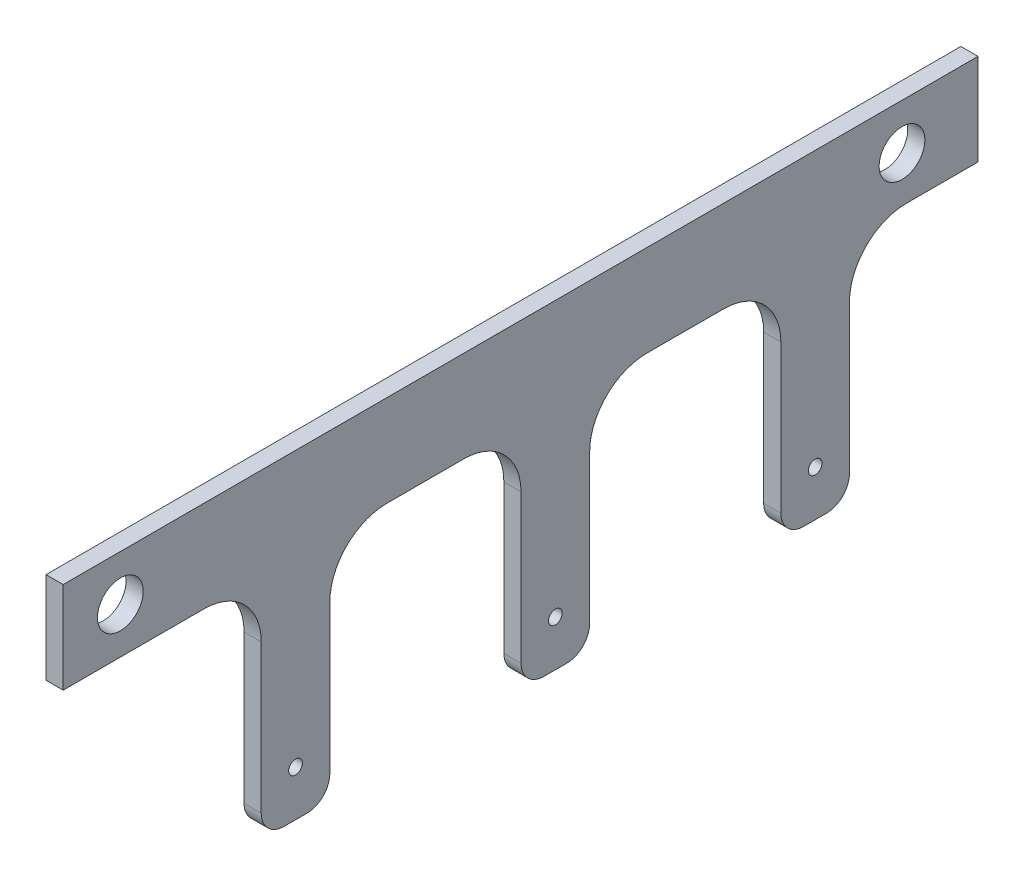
ISO-10303-21;
HEADER;
FILE_DESCRIPTION(('STEP AP214'),'2;1');
FILE_NAME('part.step','',(''),(''),'','','');
FILE_SCHEMA(('AUTOMOTIVE_DESIGN { 1 0 10303 214 1 1 1 1 }'));
ENDSEC;
DATA;
#1=APPLICATION_CONTEXT('core data for automotive mechanical design processes');
#2=APPLICATION_PROTOCOL_DEFINITION('international standard','automotive_design',2000,#1);
#3=PRODUCT_CONTEXT('',#1,'mechanical');
#4=PRODUCT('Part','Part','',(#3));
#5=PRODUCT_RELATED_PRODUCT_CATEGORY('part','',(#4));
#6=PRODUCT_DEFINITION_FORMATION('','',#4);
#7=PRODUCT_DEFINITION_CONTEXT('part definition',#1,'design');
#8=PRODUCT_DEFINITION('design','',#6,#7);
#9=PRODUCT_DEFINITION_SHAPE('','',#8);
#10=(LENGTH_UNIT() NAMED_UNIT(*) SI_UNIT(.MILLI.,.METRE.));
#11=(NAMED_UNIT(*) PLANE_ANGLE_UNIT() SI_UNIT($,.RADIAN.));
#12=(NAMED_UNIT(*) SI_UNIT($,.STERADIAN.) SOLID_ANGLE_UNIT());
#13=UNCERTAINTY_MEASURE_WITH_UNIT(LENGTH_MEASURE(1.E-05),#10,'distance_accuracy_value','');
#14=(GEOMETRIC_REPRESENTATION_CONTEXT(3) GLOBAL_UNCERTAINTY_ASSIGNED_CONTEXT((#13)) GLOBAL_UNIT_ASSIGNED_CONTEXT((#10,
#11,#12)) REPRESENTATION_CONTEXT('',''));
#15=CARTESIAN_POINT('',(0.,0.,0.));
#16=DIRECTION('',(0.,0.,1.));
#17=DIRECTION('',(1.,0.,0.));
#18=AXIS2_PLACEMENT_3D('',#15,#16,#17);
#19=CARTESIAN_POINT('',(4.7625,0.,0.));
#20=DIRECTION('',(-1.,0.,0.));
#21=DIRECTION('',(0.,0.,1.));
#22=AXIS2_PLACEMENT_3D('',#19,#20,#21);
#23=PLANE('',#22);
#24=CARTESIAN_POINT('',(4.7625,7.05604233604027,-104.389084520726));
#25=DIRECTION('',(1.,0.,0.));
#26=DIRECTION('',(0.,0.,-1.));
#27=AXIS2_PLACEMENT_3D('',#24,#25,#26);
#28=CIRCLE('',#27,6.35);
#29=CARTESIAN_POINT('',(4.7625,7.05604233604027,-110.739084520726));
#30=VERTEX_POINT('',#29);
#31=EDGE_CURVE('E486',#30,#30,#28,.T.);
#32=ORIENTED_EDGE('',*,*,#31,.F.);
#33=EDGE_LOOP('',(#32));
#34=FACE_BOUND('',#33,.T.);
#35=CARTESIAN_POINT('',(4.7625,7.05604233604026,112.634816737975));
#36=DIRECTION('',(1.,0.,0.));
#37=DIRECTION('',(0.,0.,-1.));
#38=AXIS2_PLACEMENT_3D('',#35,#36,#37);
#39=CIRCLE('',#38,6.35);
#40=CARTESIAN_POINT('',(4.7625,7.05604233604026,106.284816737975));
#41=VERTEX_POINT('',#40);
#42=EDGE_CURVE('E480',#41,#41,#39,.T.);
#43=ORIENTED_EDGE('',*,*,#42,.F.);
#44=EDGE_LOOP('',(#43));
#45=FACE_BOUND('',#44,.T.);
#46=DIRECTION('',(0.,0.,-1.));
#47=VECTOR('',#46,1.);
#48=CARTESIAN_POINT('',(4.7625,-69.0731920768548,-70.746173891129));
#49=LINE('',#48,#47);
#50=CARTESIAN_POINT('',(4.7625,-69.0731920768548,-77.096173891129));
#51=VERTEX_POINT('',#50);
#52=CARTESIAN_POINT('',(4.7625,-69.0731920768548,-83.446173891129));
#53=VERTEX_POINT('',#52);
#54=EDGE_CURVE('E441',#51,#53,#49,.T.);
#55=ORIENTED_EDGE('',*,*,#54,.T.);
#56=CARTESIAN_POINT('',(4.7625,-62.7231920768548,-83.446173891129));
#57=DIRECTION('',(-1.,0.,0.));
#58=DIRECTION('',(0.,0.,1.));
#59=AXIS2_PLACEMENT_3D('',#56,#57,#58);
#60=CIRCLE('',#59,6.35);
#61=CARTESIAN_POINT('',(4.7625,-62.7231920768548,-89.796173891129));
#62=VERTEX_POINT('',#61);
#63=EDGE_CURVE('E339',#53,#62,#60,.F.);
#64=ORIENTED_EDGE('',*,*,#63,.T.);
#65=DIRECTION('',(0.,1.,0.));
#66=VECTOR('',#65,1.);
#67=CARTESIAN_POINT('',(4.7625,-69.0731920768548,-89.796173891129));
#68=LINE('',#67,#66);
#69=CARTESIAN_POINT('',(4.7625,-21.5189576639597,-89.796173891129));
#70=VERTEX_POINT('',#69);
#71=EDGE_CURVE('E439',#62,#70,#68,.T.);
#72=ORIENTED_EDGE('',*,*,#71,.T.);
#73=CARTESIAN_POINT('',(4.7625,-21.5189576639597,-105.671173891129));
#74=DIRECTION('',(-1.,0.,0.));
#75=DIRECTION('',(0.,0.,1.));
#76=AXIS2_PLACEMENT_3D('',#73,#74,#75);
#77=CIRCLE('',#76,15.875);
#78=CARTESIAN_POINT('',(4.7625,-5.6439576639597,-105.671173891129));
#79=VERTEX_POINT('',#78);
#80=EDGE_CURVE('E286',#70,#79,#77,.T.);
#81=ORIENTED_EDGE('',*,*,#80,.T.);
#82=DIRECTION('',(0.,0.,-1.));
#83=VECTOR('',#82,1.);
#84=CARTESIAN_POINT('',(4.7625,-5.6439576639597,-89.796173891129));
#85=LINE('',#84,#83);
#86=CARTESIAN_POINT('',(4.7625,-5.64395766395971,-125.490183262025));
#87=VERTEX_POINT('',#86);
#88=EDGE_CURVE('E236',#79,#87,#85,.T.);
#89=ORIENTED_EDGE('',*,*,#88,.T.);
#90=DIRECTION('',(0.,1.,0.));
#91=VECTOR('',#90,1.);
#92=CARTESIAN_POINT('',(4.7625,-5.64395766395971,-125.490183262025));
#93=LINE('',#92,#91);
#94=CARTESIAN_POINT('',(4.7625,19.7560423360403,-125.490183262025));
#95=VERTEX_POINT('',#94);
#96=EDGE_CURVE('E230',#87,#95,#93,.T.);
#97=ORIENTED_EDGE('',*,*,#96,.T.);
#98=DIRECTION('',(0.,0.,1.));
#99=VECTOR('',#98,1.);
#100=CARTESIAN_POINT('',(4.7625,19.7560423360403,128.509816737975));
#101=LINE('',#100,#99);
#102=CARTESIAN_POINT('',(4.7625,19.7560423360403,128.509816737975));
#103=VERTEX_POINT('',#102);
#104=EDGE_CURVE('E220',#95,#103,#101,.T.);
#105=ORIENTED_EDGE('',*,*,#104,.T.);
#106=DIRECTION('',(0.,-1.,0.));
#107=VECTOR('',#106,1.);
#108=CARTESIAN_POINT('',(4.7625,-5.6439576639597,128.509816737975));
#109=LINE('',#108,#107);
#110=CARTESIAN_POINT('',(4.7625,-5.6439576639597,128.509816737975));
#111=VERTEX_POINT('',#110);
#112=EDGE_CURVE('E229',#103,#111,#109,.T.);
#113=ORIENTED_EDGE('',*,*,#112,.T.);
#114=DIRECTION('',(0.,0.,-1.));
#115=VECTOR('',#114,1.);
#116=CARTESIAN_POINT('',(4.7625,-5.6439576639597,128.509816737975));
#117=LINE('',#116,#115);
#118=CARTESIAN_POINT('',(4.7625,-5.6439576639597,89.3954360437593));
#119=VERTEX_POINT('',#118);
#120=EDGE_CURVE('E425',#111,#119,#117,.T.);
#121=ORIENTED_EDGE('',*,*,#120,.T.);
#122=CARTESIAN_POINT('',(4.7625,-21.5189576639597,89.3954360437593));
#123=DIRECTION('',(-1.,0.,0.));
#124=DIRECTION('',(0.,0.,1.));
#125=AXIS2_PLACEMENT_3D('',#122,#123,#124);
#126=CIRCLE('',#125,15.875);
#127=CARTESIAN_POINT('',(4.7625,-21.5189576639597,73.5204360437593));
#128=VERTEX_POINT('',#127);
#129=EDGE_CURVE('E308',#119,#128,#126,.T.);
#130=ORIENTED_EDGE('',*,*,#129,.T.);
#131=DIRECTION('',(0.,-1.,0.));
#132=VECTOR('',#131,1.);
#133=CARTESIAN_POINT('',(4.7625,-5.6439576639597,73.5204360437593));
#134=LINE('',#133,#132);
#135=CARTESIAN_POINT('',(4.7625,-62.7231920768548,73.5204360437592));
#136=VERTEX_POINT('',#135);
#137=EDGE_CURVE('E373',#128,#136,#134,.T.);
#138=ORIENTED_EDGE('',*,*,#137,.T.);
#139=CARTESIAN_POINT('',(4.7625,-62.7231920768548,67.1704360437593));
#140=DIRECTION('',(-1.,0.,0.));
#141=DIRECTION('',(0.,0.,1.));
#142=AXIS2_PLACEMENT_3D('',#139,#140,#141);
#143=CIRCLE('',#142,6.35);
#144=CARTESIAN_POINT('',(4.7625,-69.0731920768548,67.1704360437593));
#145=VERTEX_POINT('',#144);
#146=EDGE_CURVE('E330',#136,#145,#143,.F.);
#147=ORIENTED_EDGE('',*,*,#146,.T.);
#148=DIRECTION('',(0.,0.,-1.));
#149=VECTOR('',#148,1.);
#150=CARTESIAN_POINT('',(4.7625,-69.0731920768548,73.5204360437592));
#151=LINE('',#150,#149);
#152=CARTESIAN_POINT('',(4.7625,-69.0731920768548,60.8204360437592));
#153=VERTEX_POINT('',#152);
#154=EDGE_CURVE('E363',#145,#153,#151,.T.);
#155=ORIENTED_EDGE('',*,*,#154,.T.);
#156=CARTESIAN_POINT('',(4.7625,-62.7231920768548,60.8204360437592));
#157=DIRECTION('',(-1.,0.,0.));
#158=DIRECTION('',(0.,0.,1.));
#159=AXIS2_PLACEMENT_3D('',#156,#157,#158);
#160=CIRCLE('',#159,6.35);
#161=CARTESIAN_POINT('',(4.7625,-62.7231920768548,54.4704360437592));
#162=VERTEX_POINT('',#161);
#163=EDGE_CURVE('E332',#153,#162,#160,.F.);
#164=ORIENTED_EDGE('',*,*,#163,.T.);
#165=DIRECTION('',(0.,1.,0.));
#166=VECTOR('',#165,1.);
#167=CARTESIAN_POINT('',(4.7625,-69.0731920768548,54.4704360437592));
#168=LINE('',#167,#166);
#169=CARTESIAN_POINT('',(4.7625,-21.5189576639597,54.4704360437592));
#170=VERTEX_POINT('',#169);
#171=EDGE_CURVE('E372',#162,#170,#168,.T.);
#172=ORIENTED_EDGE('',*,*,#171,.T.);
#173=CARTESIAN_POINT('',(4.7625,-21.5189576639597,38.5954360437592));
#174=DIRECTION('',(-1.,0.,0.));
#175=DIRECTION('',(0.,0.,1.));
#176=AXIS2_PLACEMENT_3D('',#173,#174,#175);
#177=CIRCLE('',#176,15.875);
#178=CARTESIAN_POINT('',(4.7625,-5.6439576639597,38.5954360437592));
#179=VERTEX_POINT('',#178);
#180=EDGE_CURVE('E304',#170,#179,#177,.T.);
#181=ORIENTED_EDGE('',*,*,#180,.T.);
#182=DIRECTION('',(0.,0.,-1.));
#183=VECTOR('',#182,1.);
#184=CARTESIAN_POINT('',(4.7625,-5.6439576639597,54.4704360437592));
#185=LINE('',#184,#183);
#186=CARTESIAN_POINT('',(4.7625,-5.6439576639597,17.2621310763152));
#187=VERTEX_POINT('',#186);
#188=EDGE_CURVE('E455',#179,#187,#185,.T.);
#189=ORIENTED_EDGE('',*,*,#188,.T.);
#190=CARTESIAN_POINT('',(4.7625,-21.5189576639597,17.2621310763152));
#191=DIRECTION('',(-1.,0.,0.));
#192=DIRECTION('',(0.,0.,1.));
#193=AXIS2_PLACEMENT_3D('',#190,#191,#192);
#194=CIRCLE('',#193,15.875);
#195=CARTESIAN_POINT('',(4.7625,-21.5189576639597,1.38713107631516));
#196=VERTEX_POINT('',#195);
#197=EDGE_CURVE('E299',#187,#196,#194,.T.);
#198=ORIENTED_EDGE('',*,*,#197,.T.);
#199=DIRECTION('',(0.,-1.,0.));
#200=VECTOR('',#199,1.);
#201=CARTESIAN_POINT('',(4.7625,-5.6439576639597,1.38713107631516));
#202=LINE('',#201,#200);
#203=CARTESIAN_POINT('',(4.7625,-62.7231920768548,1.38713107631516));
#204=VERTEX_POINT('',#203);
#205=EDGE_CURVE('E452',#196,#204,#202,.T.);
#206=ORIENTED_EDGE('',*,*,#205,.T.);
#207=CARTESIAN_POINT('',(4.7625,-62.7231920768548,-4.96286892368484));
#208=DIRECTION('',(-1.,0.,0.));
#209=DIRECTION('',(0.,0.,1.));
#210=AXIS2_PLACEMENT_3D('',#207,#208,#209);
#211=CIRCLE('',#210,6.35);
#212=CARTESIAN_POINT('',(4.7625,-69.0731920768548,-4.96286892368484));
#213=VERTEX_POINT('',#212);
#214=EDGE_CURVE('E334',#204,#213,#211,.F.);
#215=ORIENTED_EDGE('',*,*,#214,.T.);
#216=DIRECTION('',(0.,0.,-1.));
#217=VECTOR('',#216,1.);
#218=CARTESIAN_POINT('',(4.7625,-69.0731920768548,1.38713107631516));
#219=LINE('',#218,#217);
#220=CARTESIAN_POINT('',(4.7625,-69.0731920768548,-11.3128689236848));
#221=VERTEX_POINT('',#220);
#222=EDGE_CURVE('E450',#213,#221,#219,.T.);
#223=ORIENTED_EDGE('',*,*,#222,.T.);
#224=CARTESIAN_POINT('',(4.7625,-62.7231920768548,-11.3128689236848));
#225=DIRECTION('',(-1.,0.,0.));
#226=DIRECTION('',(0.,0.,1.));
#227=AXIS2_PLACEMENT_3D('',#224,#225,#226);
#228=CIRCLE('',#227,6.35);
#229=CARTESIAN_POINT('',(4.7625,-62.7231920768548,-17.6628689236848));
#230=VERTEX_POINT('',#229);
#231=EDGE_CURVE('E56',#221,#230,#228,.F.);
#232=ORIENTED_EDGE('',*,*,#231,.T.);
#233=DIRECTION('',(0.,1.,0.));
#234=VECTOR('',#233,1.);
#235=CARTESIAN_POINT('',(4.7625,-69.0731920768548,-17.6628689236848));
#236=LINE('',#235,#234);
#237=CARTESIAN_POINT('',(4.7625,-21.5189576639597,-17.6628689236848));
#238=VERTEX_POINT('',#237);
#239=EDGE_CURVE('E448',#230,#238,#236,.T.);
#240=ORIENTED_EDGE('',*,*,#239,.T.);
#241=CARTESIAN_POINT('',(4.7625,-21.5189576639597,-33.5378689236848));
#242=DIRECTION('',(-1.,0.,0.));
#243=DIRECTION('',(0.,0.,1.));
#244=AXIS2_PLACEMENT_3D('',#241,#242,#243);
#245=CIRCLE('',#244,15.875);
#246=CARTESIAN_POINT('',(4.7625,-5.6439576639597,-33.5378689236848));
#247=VERTEX_POINT('',#246);
#248=EDGE_CURVE('E295',#238,#247,#245,.T.);
#249=ORIENTED_EDGE('',*,*,#248,.T.);
#250=DIRECTION('',(0.,0.,-1.));
#251=VECTOR('',#250,1.);
#252=CARTESIAN_POINT('',(4.7625,-5.6439576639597,-17.6628689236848));
#253=LINE('',#252,#251);
#254=CARTESIAN_POINT('',(4.7625,-5.6439576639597,-54.871173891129));
#255=VERTEX_POINT('',#254);
#256=EDGE_CURVE('E445',#247,#255,#253,.T.);
#257=ORIENTED_EDGE('',*,*,#256,.T.);
#258=CARTESIAN_POINT('',(4.7625,-21.5189576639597,-54.871173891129));
#259=DIRECTION('',(-1.,0.,0.));
#260=DIRECTION('',(0.,0.,1.));
#261=AXIS2_PLACEMENT_3D('',#258,#259,#260);
#262=CIRCLE('',#261,15.875);
#263=CARTESIAN_POINT('',(4.7625,-21.5189576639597,-70.746173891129));
#264=VERTEX_POINT('',#263);
#265=EDGE_CURVE('E290',#255,#264,#262,.T.);
#266=ORIENTED_EDGE('',*,*,#265,.T.);
#267=DIRECTION('',(0.,-1.,0.));
#268=VECTOR('',#267,1.);
#269=CARTESIAN_POINT('',(4.7625,-5.6439576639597,-70.746173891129));
#270=LINE('',#269,#268);
#271=CARTESIAN_POINT('',(4.7625,-62.7231920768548,-70.746173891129));
#272=VERTEX_POINT('',#271);
#273=EDGE_CURVE('E443',#264,#272,#270,.T.);
#274=ORIENTED_EDGE('',*,*,#273,.T.);
#275=CARTESIAN_POINT('',(4.7625,-62.7231920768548,-77.096173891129));
#276=DIRECTION('',(-1.,0.,0.));
#277=DIRECTION('',(0.,0.,1.));
#278=AXIS2_PLACEMENT_3D('',#275,#276,#277);
#279=CIRCLE('',#278,6.35);
#280=EDGE_CURVE('E337',#272,#51,#279,.F.);
#281=ORIENTED_EDGE('',*,*,#280,.T.);
#282=EDGE_LOOP('',(#55,#64,#72,#81,#89,#97,#105,#113,#121,#130,#138,#147,#155,#164,#172,#181,
#189,#198,#206,#215,#223,#232,#240,#249,#257,#266,#274,#281));
#283=FACE_BOUND('',#282,.T.);
#284=CARTESIAN_POINT('',(4.7625,-56.3731920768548,63.9954360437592));
#285=DIRECTION('',(1.,0.,0.));
#286=DIRECTION('',(0.,0.,-1.));
#287=AXIS2_PLACEMENT_3D('',#284,#285,#286);
#288=CIRCLE('',#287,1.905);
#289=CARTESIAN_POINT('',(4.7625,-56.3731920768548,65.9004360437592));
#290=VERTEX_POINT('',#289);
#291=EDGE_CURVE('E437',#290,#290,#288,.T.);
#292=ORIENTED_EDGE('',*,*,#291,.F.);
#293=EDGE_LOOP('',(#292));
#294=FACE_BOUND('',#293,.T.);
#295=CARTESIAN_POINT('',(4.7625,-56.3731920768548,-8.13786892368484));
#296=DIRECTION('',(1.,0.,0.));
#297=DIRECTION('',(0.,0.,-1.));
#298=AXIS2_PLACEMENT_3D('',#295,#296,#297);
#299=CIRCLE('',#298,1.905);
#300=CARTESIAN_POINT('',(4.7625,-56.3731920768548,-6.23286892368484));
#301=VERTEX_POINT('',#300);
#302=EDGE_CURVE('E465',#301,#301,#299,.T.);
#303=ORIENTED_EDGE('',*,*,#302,.F.);
#304=EDGE_LOOP('',(#303));
#305=FACE_BOUND('',#304,.T.);
#306=CARTESIAN_POINT('',(4.7625,-56.3731920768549,-80.271173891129));
#307=DIRECTION('',(1.,0.,0.));
#308=DIRECTION('',(0.,0.,-1.));
#309=AXIS2_PLACEMENT_3D('',#306,#307,#308);
#310=CIRCLE('',#309,1.90500000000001);
#311=CARTESIAN_POINT('',(4.7625,-56.3731920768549,-78.366173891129));
#312=VERTEX_POINT('',#311);
#313=EDGE_CURVE('E471',#312,#312,#310,.T.);
#314=ORIENTED_EDGE('',*,*,#313,.F.);
#315=EDGE_LOOP('',(#314));
#316=FACE_BOUND('',#315,.T.);
#317=ADVANCED_FACE('F33',(#34,#45,#283,#294,#305,#316),#23,.F.);
#318=CARTESIAN_POINT('',(0.,0.,0.));
#319=DIRECTION('',(-1.,0.,0.));
#320=DIRECTION('',(0.,0.,1.));
#321=AXIS2_PLACEMENT_3D('',#318,#319,#320);
#322=PLANE('',#321);
#323=CARTESIAN_POINT('',(0.,7.05604233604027,-104.389084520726));
#324=DIRECTION('',(1.,0.,0.));
#325=DIRECTION('',(0.,0.,-1.));
#326=AXIS2_PLACEMENT_3D('',#323,#324,#325);
#327=CIRCLE('',#326,6.35);
#328=CARTESIAN_POINT('',(0.,7.05604233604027,-110.739084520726));
#329=VERTEX_POINT('',#328);
#330=EDGE_CURVE('E483',#329,#329,#327,.T.);
#331=ORIENTED_EDGE('',*,*,#330,.T.);
#332=EDGE_LOOP('',(#331));
#333=FACE_BOUND('',#332,.T.);
#334=CARTESIAN_POINT('',(0.,7.05604233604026,112.634816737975));
#335=DIRECTION('',(1.,0.,0.));
#336=DIRECTION('',(0.,0.,-1.));
#337=AXIS2_PLACEMENT_3D('',#334,#335,#336);
#338=CIRCLE('',#337,6.35);
#339=CARTESIAN_POINT('',(0.,7.05604233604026,106.284816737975));
#340=VERTEX_POINT('',#339);
#341=EDGE_CURVE('E477',#340,#340,#338,.T.);
#342=ORIENTED_EDGE('',*,*,#341,.T.);
#343=EDGE_LOOP('',(#342));
#344=FACE_BOUND('',#343,.T.);
#345=CARTESIAN_POINT('',(0.,-56.3731920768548,-8.13786892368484));
#346=DIRECTION('',(1.,0.,0.));
#347=DIRECTION('',(0.,0.,-1.));
#348=AXIS2_PLACEMENT_3D('',#345,#346,#347);
#349=CIRCLE('',#348,1.905);
#350=CARTESIAN_POINT('',(0.,-56.3731920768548,-6.23286892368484));
#351=VERTEX_POINT('',#350);
#352=EDGE_CURVE('E468',#351,#351,#349,.T.);
#353=ORIENTED_EDGE('',*,*,#352,.T.);
#354=EDGE_LOOP('',(#353));
#355=FACE_BOUND('',#354,.T.);
#356=DIRECTION('',(0.,1.,0.));
#357=VECTOR('',#356,1.);
#358=CARTESIAN_POINT('',(0.,-69.0731920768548,-89.796173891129));
#359=LINE('',#358,#357);
#360=CARTESIAN_POINT('',(0.,-62.7231920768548,-89.796173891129));
#361=VERTEX_POINT('',#360);
#362=CARTESIAN_POINT('',(0.,-21.5189576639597,-89.796173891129));
#363=VERTEX_POINT('',#362);
#364=EDGE_CURVE('E411',#361,#363,#359,.T.);
#365=ORIENTED_EDGE('',*,*,#364,.F.);
#366=CARTESIAN_POINT('',(0.,-62.7231920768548,-83.446173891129));
#367=DIRECTION('',(-1.,0.,0.));
#368=DIRECTION('',(0.,0.,1.));
#369=AXIS2_PLACEMENT_3D('',#366,#367,#368);
#370=CIRCLE('',#369,6.35);
#371=CARTESIAN_POINT('',(0.,-69.0731920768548,-83.446173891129));
#372=VERTEX_POINT('',#371);
#373=EDGE_CURVE('E323',#361,#372,#370,.T.);
#374=ORIENTED_EDGE('',*,*,#373,.T.);
#375=DIRECTION('',(0.,0.,-1.));
#376=VECTOR('',#375,1.);
#377=CARTESIAN_POINT('',(0.,-69.0731920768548,-70.746173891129));
#378=LINE('',#377,#376);
#379=CARTESIAN_POINT('',(0.,-69.0731920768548,-77.096173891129));
#380=VERTEX_POINT('',#379);
#381=EDGE_CURVE('E408',#380,#372,#378,.T.);
#382=ORIENTED_EDGE('',*,*,#381,.F.);
#383=CARTESIAN_POINT('',(0.,-62.7231920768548,-77.096173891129));
#384=DIRECTION('',(-1.,0.,0.));
#385=DIRECTION('',(0.,0.,1.));
#386=AXIS2_PLACEMENT_3D('',#383,#384,#385);
#387=CIRCLE('',#386,6.35);
#388=CARTESIAN_POINT('',(0.,-62.7231920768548,-70.746173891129));
#389=VERTEX_POINT('',#388);
#390=EDGE_CURVE('E321',#380,#389,#387,.T.);
#391=ORIENTED_EDGE('',*,*,#390,.T.);
#392=DIRECTION('',(0.,-1.,0.));
#393=VECTOR('',#392,1.);
#394=CARTESIAN_POINT('',(0.,-5.6439576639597,-70.746173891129));
#395=LINE('',#394,#393);
#396=CARTESIAN_POINT('',(0.,-21.5189576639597,-70.746173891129));
#397=VERTEX_POINT('',#396);
#398=EDGE_CURVE('E406',#397,#389,#395,.T.);
#399=ORIENTED_EDGE('',*,*,#398,.F.);
#400=CARTESIAN_POINT('',(0.,-21.5189576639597,-54.871173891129));
#401=DIRECTION('',(-1.,0.,0.));
#402=DIRECTION('',(0.,0.,1.));
#403=AXIS2_PLACEMENT_3D('',#400,#401,#402);
#404=CIRCLE('',#403,15.875);
#405=CARTESIAN_POINT('',(0.,-5.6439576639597,-54.871173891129));
#406=VERTEX_POINT('',#405);
#407=EDGE_CURVE('E288',#397,#406,#404,.F.);
#408=ORIENTED_EDGE('',*,*,#407,.T.);
#409=DIRECTION('',(0.,0.,-1.));
#410=VECTOR('',#409,1.);
#411=CARTESIAN_POINT('',(0.,-5.6439576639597,-17.6628689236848));
#412=LINE('',#411,#410);
#413=CARTESIAN_POINT('',(0.,-5.6439576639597,-33.5378689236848));
#414=VERTEX_POINT('',#413);
#415=EDGE_CURVE('E403',#414,#406,#412,.T.);
#416=ORIENTED_EDGE('',*,*,#415,.F.);
#417=CARTESIAN_POINT('',(0.,-21.5189576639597,-33.5378689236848));
#418=DIRECTION('',(-1.,0.,0.));
#419=DIRECTION('',(0.,0.,1.));
#420=AXIS2_PLACEMENT_3D('',#417,#418,#419);
#421=CIRCLE('',#420,15.875);
#422=CARTESIAN_POINT('',(0.,-21.5189576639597,-17.6628689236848));
#423=VERTEX_POINT('',#422);
#424=EDGE_CURVE('E292',#414,#423,#421,.F.);
#425=ORIENTED_EDGE('',*,*,#424,.T.);
#426=DIRECTION('',(0.,1.,0.));
#427=VECTOR('',#426,1.);
#428=CARTESIAN_POINT('',(0.,-69.0731920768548,-17.6628689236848));
#429=LINE('',#428,#427);
#430=CARTESIAN_POINT('',(0.,-62.7231920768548,-17.6628689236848));
#431=VERTEX_POINT('',#430);
#432=EDGE_CURVE('E401',#431,#423,#429,.T.);
#433=ORIENTED_EDGE('',*,*,#432,.F.);
#434=CARTESIAN_POINT('',(0.,-62.7231920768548,-11.3128689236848));
#435=DIRECTION('',(-1.,0.,0.));
#436=DIRECTION('',(0.,0.,1.));
#437=AXIS2_PLACEMENT_3D('',#434,#435,#436);
#438=CIRCLE('',#437,6.35);
#439=CARTESIAN_POINT('',(0.,-69.0731920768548,-11.3128689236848));
#440=VERTEX_POINT('',#439);
#441=EDGE_CURVE('E319',#431,#440,#438,.T.);
#442=ORIENTED_EDGE('',*,*,#441,.T.);
#443=DIRECTION('',(0.,0.,-1.));
#444=VECTOR('',#443,1.);
#445=CARTESIAN_POINT('',(0.,-69.0731920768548,1.38713107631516));
#446=LINE('',#445,#444);
#447=CARTESIAN_POINT('',(0.,-69.0731920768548,-4.96286892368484));
#448=VERTEX_POINT('',#447);
#449=EDGE_CURVE('E398',#448,#440,#446,.T.);
#450=ORIENTED_EDGE('',*,*,#449,.F.);
#451=CARTESIAN_POINT('',(0.,-62.7231920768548,-4.96286892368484));
#452=DIRECTION('',(-1.,0.,0.));
#453=DIRECTION('',(0.,0.,1.));
#454=AXIS2_PLACEMENT_3D('',#451,#452,#453);
#455=CIRCLE('',#454,6.35);
#456=CARTESIAN_POINT('',(0.,-62.7231920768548,1.38713107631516));
#457=VERTEX_POINT('',#456);
#458=EDGE_CURVE('E317',#448,#457,#455,.T.);
#459=ORIENTED_EDGE('',*,*,#458,.T.);
#460=DIRECTION('',(0.,-1.,0.));
#461=VECTOR('',#460,1.);
#462=CARTESIAN_POINT('',(0.,-5.6439576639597,1.38713107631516));
#463=LINE('',#462,#461);
#464=CARTESIAN_POINT('',(0.,-21.5189576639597,1.38713107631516));
#465=VERTEX_POINT('',#464);
#466=EDGE_CURVE('E390',#465,#457,#463,.T.);
#467=ORIENTED_EDGE('',*,*,#466,.F.);
#468=CARTESIAN_POINT('',(0.,-21.5189576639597,17.2621310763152));
#469=DIRECTION('',(-1.,0.,0.));
#470=DIRECTION('',(0.,0.,1.));
#471=AXIS2_PLACEMENT_3D('',#468,#469,#470);
#472=CIRCLE('',#471,15.875);
#473=CARTESIAN_POINT('',(0.,-5.6439576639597,17.2621310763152));
#474=VERTEX_POINT('',#473);
#475=EDGE_CURVE('E297',#465,#474,#472,.F.);
#476=ORIENTED_EDGE('',*,*,#475,.T.);
#477=DIRECTION('',(0.,0.,-1.));
#478=VECTOR('',#477,1.);
#479=CARTESIAN_POINT('',(0.,-5.6439576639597,54.4704360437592));
#480=LINE('',#479,#478);
#481=CARTESIAN_POINT('',(0.,-5.6439576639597,38.5954360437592));
#482=VERTEX_POINT('',#481);
#483=EDGE_CURVE('E387',#482,#474,#480,.T.);
#484=ORIENTED_EDGE('',*,*,#483,.F.);
#485=CARTESIAN_POINT('',(0.,-21.5189576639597,38.5954360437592));
#486=DIRECTION('',(-1.,0.,0.));
#487=DIRECTION('',(0.,0.,1.));
#488=AXIS2_PLACEMENT_3D('',#485,#486,#487);
#489=CIRCLE('',#488,15.875);
#490=CARTESIAN_POINT('',(0.,-21.5189576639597,54.4704360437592));
#491=VERTEX_POINT('',#490);
#492=EDGE_CURVE('E301',#482,#491,#489,.F.);
#493=ORIENTED_EDGE('',*,*,#492,.T.);
#494=DIRECTION('',(0.,1.,0.));
#495=VECTOR('',#494,1.);
#496=CARTESIAN_POINT('',(0.,-69.0731920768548,54.4704360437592));
#497=LINE('',#496,#495);
#498=CARTESIAN_POINT('',(0.,-62.7231920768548,54.4704360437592));
#499=VERTEX_POINT('',#498);
#500=EDGE_CURVE('E380',#499,#491,#497,.T.);
#501=ORIENTED_EDGE('',*,*,#500,.F.);
#502=CARTESIAN_POINT('',(0.,-62.7231920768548,60.8204360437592));
#503=DIRECTION('',(-1.,0.,0.));
#504=DIRECTION('',(0.,0.,1.));
#505=AXIS2_PLACEMENT_3D('',#502,#503,#504);
#506=CIRCLE('',#505,6.35);
#507=CARTESIAN_POINT('',(0.,-69.0731920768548,60.8204360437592));
#508=VERTEX_POINT('',#507);
#509=EDGE_CURVE('E315',#499,#508,#506,.T.);
#510=ORIENTED_EDGE('',*,*,#509,.T.);
#511=DIRECTION('',(0.,0.,-1.));
#512=VECTOR('',#511,1.);
#513=CARTESIAN_POINT('',(0.,-69.0731920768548,73.5204360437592));
#514=LINE('',#513,#512);
#515=CARTESIAN_POINT('',(0.,-69.0731920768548,67.1704360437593));
#516=VERTEX_POINT('',#515);
#517=EDGE_CURVE('E366',#516,#508,#514,.T.);
#518=ORIENTED_EDGE('',*,*,#517,.F.);
#519=CARTESIAN_POINT('',(0.,-62.7231920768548,67.1704360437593));
#520=DIRECTION('',(-1.,0.,0.));
#521=DIRECTION('',(0.,0.,1.));
#522=AXIS2_PLACEMENT_3D('',#519,#520,#521);
#523=CIRCLE('',#522,6.35);
#524=CARTESIAN_POINT('',(0.,-62.7231920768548,73.5204360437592));
#525=VERTEX_POINT('',#524);
#526=EDGE_CURVE('E313',#516,#525,#523,.T.);
#527=ORIENTED_EDGE('',*,*,#526,.T.);
#528=DIRECTION('',(0.,-1.,0.));
#529=VECTOR('',#528,1.);
#530=CARTESIAN_POINT('',(0.,-5.6439576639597,73.5204360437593));
#531=LINE('',#530,#529);
#532=CARTESIAN_POINT('',(0.,-21.5189576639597,73.5204360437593));
#533=VERTEX_POINT('',#532);
#534=EDGE_CURVE('E392',#533,#525,#531,.T.);
#535=ORIENTED_EDGE('',*,*,#534,.F.);
#536=CARTESIAN_POINT('',(0.,-21.5189576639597,89.3954360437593));
#537=DIRECTION('',(-1.,0.,0.));
#538=DIRECTION('',(0.,0.,1.));
#539=AXIS2_PLACEMENT_3D('',#536,#537,#538);
#540=CIRCLE('',#539,15.875);
#541=CARTESIAN_POINT('',(0.,-5.6439576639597,89.3954360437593));
#542=VERTEX_POINT('',#541);
#543=EDGE_CURVE('E306',#533,#542,#540,.F.);
#544=ORIENTED_EDGE('',*,*,#543,.T.);
#545=DIRECTION('',(0.,0.,-1.));
#546=VECTOR('',#545,1.);
#547=CARTESIAN_POINT('',(0.,-5.6439576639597,128.509816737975));
#548=LINE('',#547,#546);
#549=CARTESIAN_POINT('',(0.,-5.6439576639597,128.509816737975));
#550=VERTEX_POINT('',#549);
#551=EDGE_CURVE('E422',#550,#542,#548,.T.);
#552=ORIENTED_EDGE('',*,*,#551,.F.);
#553=DIRECTION('',(0.,-1.,0.));
#554=VECTOR('',#553,1.);
#555=CARTESIAN_POINT('',(0.,-5.6439576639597,128.509816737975));
#556=LINE('',#555,#554);
#557=CARTESIAN_POINT('',(0.,19.7560423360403,128.509816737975));
#558=VERTEX_POINT('',#557);
#559=EDGE_CURVE('E428',#558,#550,#556,.T.);
#560=ORIENTED_EDGE('',*,*,#559,.F.);
#561=DIRECTION('',(0.,0.,1.));
#562=VECTOR('',#561,1.);
#563=CARTESIAN_POINT('',(0.,19.7560423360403,128.509816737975));
#564=LINE('',#563,#562);
#565=CARTESIAN_POINT('',(0.,19.7560423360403,-125.490183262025));
#566=VERTEX_POINT('',#565);
#567=EDGE_CURVE('E432',#566,#558,#564,.T.);
#568=ORIENTED_EDGE('',*,*,#567,.F.);
#569=DIRECTION('',(0.,1.,0.));
#570=VECTOR('',#569,1.);
#571=CARTESIAN_POINT('',(0.,-5.64395766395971,-125.490183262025));
#572=LINE('',#571,#570);
#573=CARTESIAN_POINT('',(0.,-5.64395766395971,-125.490183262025));
#574=VERTEX_POINT('',#573);
#575=EDGE_CURVE('E244',#574,#566,#572,.T.);
#576=ORIENTED_EDGE('',*,*,#575,.F.);
#577=DIRECTION('',(0.,0.,-1.));
#578=VECTOR('',#577,1.);
#579=CARTESIAN_POINT('',(0.,-5.6439576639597,-89.796173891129));
#580=LINE('',#579,#578);
#581=CARTESIAN_POINT('',(0.,-5.6439576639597,-105.671173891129));
#582=VERTEX_POINT('',#581);
#583=EDGE_CURVE('E240',#582,#574,#580,.T.);
#584=ORIENTED_EDGE('',*,*,#583,.F.);
#585=CARTESIAN_POINT('',(0.,-21.5189576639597,-105.671173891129));
#586=DIRECTION('',(-1.,0.,0.));
#587=DIRECTION('',(0.,0.,1.));
#588=AXIS2_PLACEMENT_3D('',#585,#586,#587);
#589=CIRCLE('',#588,15.875);
#590=EDGE_CURVE('E283',#582,#363,#589,.F.);
#591=ORIENTED_EDGE('',*,*,#590,.T.);
#592=EDGE_LOOP('',(#365,#374,#382,#391,#399,#408,#416,#425,#433,#442,#450,#459,#467,#476,#484,
#493,#501,#510,#518,#527,#535,#544,#552,#560,#568,#576,#584,#591));
#593=FACE_BOUND('',#592,.T.);
#594=CARTESIAN_POINT('',(0.,-56.3731920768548,63.9954360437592));
#595=DIRECTION('',(1.,0.,0.));
#596=DIRECTION('',(0.,0.,-1.));
#597=AXIS2_PLACEMENT_3D('',#594,#595,#596);
#598=CIRCLE('',#597,1.905);
#599=CARTESIAN_POINT('',(0.,-56.3731920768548,65.9004360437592));
#600=VERTEX_POINT('',#599);
#601=EDGE_CURVE('E462',#600,#600,#598,.T.);
#602=ORIENTED_EDGE('',*,*,#601,.T.);
#603=EDGE_LOOP('',(#602));
#604=FACE_BOUND('',#603,.T.);
#605=CARTESIAN_POINT('',(0.,-56.3731920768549,-80.271173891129));
#606=DIRECTION('',(1.,0.,0.));
#607=DIRECTION('',(0.,0.,-1.));
#608=AXIS2_PLACEMENT_3D('',#605,#606,#607);
#609=CIRCLE('',#608,1.90500000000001);
#610=CARTESIAN_POINT('',(0.,-56.3731920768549,-78.366173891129));
#611=VERTEX_POINT('',#610);
#612=EDGE_CURVE('E474',#611,#611,#609,.T.);
#613=ORIENTED_EDGE('',*,*,#612,.T.);
#614=EDGE_LOOP('',(#613));
#615=FACE_BOUND('',#614,.T.);
#616=ADVANCED_FACE('F383',(#333,#344,#355,#593,#604,#615),#322,.T.);
#617=CARTESIAN_POINT('',(4.7625,-5.64395766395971,-125.490183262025));
#618=DIRECTION('',(0.,0.,1.));
#619=DIRECTION('',(1.,0.,0.));
#620=AXIS2_PLACEMENT_3D('',#617,#618,#619);
#621=PLANE('',#620);
#622=ORIENTED_EDGE('',*,*,#575,.T.);
#623=DIRECTION('',(-1.,0.,0.));
#624=VECTOR('',#623,1.);
#625=CARTESIAN_POINT('',(4.7625,19.7560423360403,-125.490183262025));
#626=LINE('',#625,#624);
#627=EDGE_CURVE('E224',#95,#566,#626,.T.);
#628=ORIENTED_EDGE('',*,*,#627,.F.);
#629=ORIENTED_EDGE('',*,*,#96,.F.);
#630=DIRECTION('',(-1.,0.,0.));
#631=VECTOR('',#630,1.);
#632=CARTESIAN_POINT('',(4.7625,-5.64395766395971,-125.490183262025));
#633=LINE('',#632,#631);
#634=EDGE_CURVE('E414',#87,#574,#633,.T.);
#635=ORIENTED_EDGE('',*,*,#634,.T.);
#636=EDGE_LOOP('',(#622,#628,#629,#635));
#637=FACE_BOUND('',#636,.T.);
#638=ADVANCED_FACE('F242',(#637),#621,.F.);
#639=CARTESIAN_POINT('',(4.7625,19.7560423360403,128.509816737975));
#640=DIRECTION('',(0.,-1.,0.));
#641=DIRECTION('',(0.,0.,-1.));
#642=AXIS2_PLACEMENT_3D('',#639,#640,#641);
#643=PLANE('',#642);
#644=ORIENTED_EDGE('',*,*,#567,.T.);
#645=DIRECTION('',(-1.,0.,0.));
#646=VECTOR('',#645,1.);
#647=CARTESIAN_POINT('',(4.7625,19.7560423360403,128.509816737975));
#648=LINE('',#647,#646);
#649=EDGE_CURVE('E227',#103,#558,#648,.T.);
#650=ORIENTED_EDGE('',*,*,#649,.F.);
#651=ORIENTED_EDGE('',*,*,#104,.F.);
#652=ORIENTED_EDGE('',*,*,#627,.T.);
#653=EDGE_LOOP('',(#644,#650,#651,#652));
#654=FACE_BOUND('',#653,.T.);
#655=ADVANCED_FACE('F222',(#654),#643,.F.);
#656=CARTESIAN_POINT('',(4.7625,-5.6439576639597,128.509816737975));
#657=DIRECTION('',(0.,0.,-1.));
#658=DIRECTION('',(0.,1.,0.));
#659=AXIS2_PLACEMENT_3D('',#656,#657,#658);
#660=PLANE('',#659);
#661=ORIENTED_EDGE('',*,*,#559,.T.);
#662=DIRECTION('',(-1.,0.,0.));
#663=VECTOR('',#662,1.);
#664=CARTESIAN_POINT('',(4.7625,-5.6439576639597,128.509816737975));
#665=LINE('',#664,#663);
#666=EDGE_CURVE('E250',#111,#550,#665,.T.);
#667=ORIENTED_EDGE('',*,*,#666,.F.);
#668=ORIENTED_EDGE('',*,*,#112,.F.);
#669=ORIENTED_EDGE('',*,*,#649,.T.);
#670=EDGE_LOOP('',(#661,#667,#668,#669));
#671=FACE_BOUND('',#670,.T.);
#672=ADVANCED_FACE('F573',(#671),#660,.F.);
#673=CARTESIAN_POINT('',(4.7625,-5.6439576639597,128.509816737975));
#674=DIRECTION('',(0.,1.,0.));
#675=DIRECTION('',(0.,0.,1.));
#676=AXIS2_PLACEMENT_3D('',#673,#674,#675);
#677=PLANE('',#676);
#678=ORIENTED_EDGE('',*,*,#551,.T.);
#679=DIRECTION('',(-1.,0.,0.));
#680=VECTOR('',#679,1.);
#681=CARTESIAN_POINT('',(4.7625,-5.6439576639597,89.3954360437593));
#682=LINE('',#681,#680);
#683=EDGE_CURVE('E281',#542,#119,#682,.F.);
#684=ORIENTED_EDGE('',*,*,#683,.T.);
#685=ORIENTED_EDGE('',*,*,#120,.F.);
#686=ORIENTED_EDGE('',*,*,#666,.T.);
#687=EDGE_LOOP('',(#678,#684,#685,#686));
#688=FACE_BOUND('',#687,.T.);
#689=ADVANCED_FACE('F421',(#688),#677,.F.);
#690=CARTESIAN_POINT('',(4.7625,-5.6439576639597,73.5204360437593));
#691=DIRECTION('',(0.,0.,-1.));
#692=DIRECTION('',(0.,1.,0.));
#693=AXIS2_PLACEMENT_3D('',#690,#691,#692);
#694=PLANE('',#693);
#695=ORIENTED_EDGE('',*,*,#534,.T.);
#696=DIRECTION('',(-1.,0.,0.));
#697=VECTOR('',#696,1.);
#698=CARTESIAN_POINT('',(4.7625,-62.7231920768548,73.5204360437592));
#699=LINE('',#698,#697);
#700=EDGE_CURVE('E11',#525,#136,#699,.F.);
#701=ORIENTED_EDGE('',*,*,#700,.T.);
#702=ORIENTED_EDGE('',*,*,#137,.F.);
#703=DIRECTION('',(-1.,0.,0.));
#704=VECTOR('',#703,1.);
#705=CARTESIAN_POINT('',(0.,-21.5189576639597,73.5204360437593));
#706=LINE('',#705,#704);
#707=EDGE_CURVE('E278',#128,#533,#706,.T.);
#708=ORIENTED_EDGE('',*,*,#707,.T.);
#709=EDGE_LOOP('',(#695,#701,#702,#708));
#710=FACE_BOUND('',#709,.T.);
#711=ADVANCED_FACE('F567',(#710),#694,.F.);
#712=CARTESIAN_POINT('',(4.7625,-69.0731920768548,73.5204360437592));
#713=DIRECTION('',(0.,1.,0.));
#714=DIRECTION('',(0.,0.,1.));
#715=AXIS2_PLACEMENT_3D('',#712,#713,#714);
#716=PLANE('',#715);
#717=ORIENTED_EDGE('',*,*,#517,.T.);
#718=DIRECTION('',(-1.,0.,0.));
#719=VECTOR('',#718,1.);
#720=CARTESIAN_POINT('',(4.7625,-69.0731920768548,60.8204360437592));
#721=LINE('',#720,#719);
#722=EDGE_CURVE('E41',#508,#153,#721,.F.);
#723=ORIENTED_EDGE('',*,*,#722,.T.);
#724=ORIENTED_EDGE('',*,*,#154,.F.);
#725=DIRECTION('',(-1.,0.,0.));
#726=VECTOR('',#725,1.);
#727=CARTESIAN_POINT('',(4.7625,-69.0731920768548,67.1704360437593));
#728=LINE('',#727,#726);
#729=EDGE_CURVE('E355',#145,#516,#728,.T.);
#730=ORIENTED_EDGE('',*,*,#729,.T.);
#731=EDGE_LOOP('',(#717,#723,#724,#730));
#732=FACE_BOUND('',#731,.T.);
#733=ADVANCED_FACE('F362',(#732),#716,.F.);
#734=CARTESIAN_POINT('',(4.7625,-69.0731920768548,54.4704360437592));
#735=DIRECTION('',(0.,0.,1.));
#736=DIRECTION('',(0.,-1.,0.));
#737=AXIS2_PLACEMENT_3D('',#734,#735,#736);
#738=PLANE('',#737);
#739=ORIENTED_EDGE('',*,*,#171,.F.);
#740=DIRECTION('',(-1.,0.,0.));
#741=VECTOR('',#740,1.);
#742=CARTESIAN_POINT('',(4.7625,-62.7231920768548,54.4704360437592));
#743=LINE('',#742,#741);
#744=EDGE_CURVE('E352',#162,#499,#743,.T.);
#745=ORIENTED_EDGE('',*,*,#744,.T.);
#746=ORIENTED_EDGE('',*,*,#500,.T.);
#747=DIRECTION('',(-1.,0.,0.));
#748=VECTOR('',#747,1.);
#749=CARTESIAN_POINT('',(4.7625,-21.5189576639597,54.4704360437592));
#750=LINE('',#749,#748);
#751=EDGE_CURVE('E275',#491,#170,#750,.F.);
#752=ORIENTED_EDGE('',*,*,#751,.T.);
#753=EDGE_LOOP('',(#739,#745,#746,#752));
#754=FACE_BOUND('',#753,.T.);
#755=ADVANCED_FACE('F379',(#754),#738,.F.);
#756=CARTESIAN_POINT('',(4.7625,-5.6439576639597,54.4704360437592));
#757=DIRECTION('',(0.,1.,0.));
#758=DIRECTION('',(0.,0.,1.));
#759=AXIS2_PLACEMENT_3D('',#756,#757,#758);
#760=PLANE('',#759);
#761=ORIENTED_EDGE('',*,*,#483,.T.);
#762=DIRECTION('',(-1.,0.,0.));
#763=VECTOR('',#762,1.);
#764=CARTESIAN_POINT('',(4.7625,-5.64395766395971,17.2621310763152));
#765=LINE('',#764,#763);
#766=EDGE_CURVE('E273',#474,#187,#765,.F.);
#767=ORIENTED_EDGE('',*,*,#766,.T.);
#768=ORIENTED_EDGE('',*,*,#188,.F.);
#769=DIRECTION('',(-1.,0.,0.));
#770=VECTOR('',#769,1.);
#771=CARTESIAN_POINT('',(0.,-5.64395766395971,38.5954360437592));
#772=LINE('',#771,#770);
#773=EDGE_CURVE('E270',#179,#482,#772,.T.);
#774=ORIENTED_EDGE('',*,*,#773,.T.);
#775=EDGE_LOOP('',(#761,#767,#768,#774));
#776=FACE_BOUND('',#775,.T.);
#777=ADVANCED_FACE('F558',(#776),#760,.F.);
#778=CARTESIAN_POINT('',(4.7625,-5.6439576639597,1.38713107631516));
#779=DIRECTION('',(0.,0.,-1.));
#780=DIRECTION('',(0.,1.,0.));
#781=AXIS2_PLACEMENT_3D('',#778,#779,#780);
#782=PLANE('',#781);
#783=ORIENTED_EDGE('',*,*,#466,.T.);
#784=DIRECTION('',(-1.,0.,0.));
#785=VECTOR('',#784,1.);
#786=CARTESIAN_POINT('',(4.7625,-62.7231920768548,1.38713107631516));
#787=LINE('',#786,#785);
#788=EDGE_CURVE('E350',#457,#204,#787,.F.);
#789=ORIENTED_EDGE('',*,*,#788,.T.);
#790=ORIENTED_EDGE('',*,*,#205,.F.);
#791=DIRECTION('',(-1.,0.,0.));
#792=VECTOR('',#791,1.);
#793=CARTESIAN_POINT('',(0.,-21.5189576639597,1.38713107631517));
#794=LINE('',#793,#792);
#795=EDGE_CURVE('E267',#196,#465,#794,.T.);
#796=ORIENTED_EDGE('',*,*,#795,.T.);
#797=EDGE_LOOP('',(#783,#789,#790,#796));
#798=FACE_BOUND('',#797,.T.);
#799=ADVANCED_FACE('F554',(#798),#782,.F.);
#800=CARTESIAN_POINT('',(4.7625,-69.0731920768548,1.38713107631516));
#801=DIRECTION('',(0.,1.,0.));
#802=DIRECTION('',(0.,0.,1.));
#803=AXIS2_PLACEMENT_3D('',#800,#801,#802);
#804=PLANE('',#803);
#805=ORIENTED_EDGE('',*,*,#449,.T.);
#806=DIRECTION('',(-1.,0.,0.));
#807=VECTOR('',#806,1.);
#808=CARTESIAN_POINT('',(4.7625,-69.0731920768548,-11.3128689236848));
#809=LINE('',#808,#807);
#810=EDGE_CURVE('E348',#440,#221,#809,.F.);
#811=ORIENTED_EDGE('',*,*,#810,.T.);
#812=ORIENTED_EDGE('',*,*,#222,.F.);
#813=DIRECTION('',(-1.,0.,0.));
#814=VECTOR('',#813,1.);
#815=CARTESIAN_POINT('',(4.7625,-69.0731920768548,-4.96286892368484));
#816=LINE('',#815,#814);
#817=EDGE_CURVE('E345',#213,#448,#816,.T.);
#818=ORIENTED_EDGE('',*,*,#817,.T.);
#819=EDGE_LOOP('',(#805,#811,#812,#818));
#820=FACE_BOUND('',#819,.T.);
#821=ADVANCED_FACE('F550',(#820),#804,.F.);
#822=CARTESIAN_POINT('',(4.7625,-69.0731920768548,-17.6628689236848));
#823=DIRECTION('',(0.,0.,1.));
#824=DIRECTION('',(0.,-1.,0.));
#825=AXIS2_PLACEMENT_3D('',#822,#823,#824);
#826=PLANE('',#825);
#827=ORIENTED_EDGE('',*,*,#239,.F.);
#828=DIRECTION('',(-1.,0.,0.));
#829=VECTOR('',#828,1.);
#830=CARTESIAN_POINT('',(4.7625,-62.7231920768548,-17.6628689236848));
#831=LINE('',#830,#829);
#832=EDGE_CURVE('E342',#230,#431,#831,.T.);
#833=ORIENTED_EDGE('',*,*,#832,.T.);
#834=ORIENTED_EDGE('',*,*,#432,.T.);
#835=DIRECTION('',(-1.,0.,0.));
#836=VECTOR('',#835,1.);
#837=CARTESIAN_POINT('',(4.7625,-21.5189576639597,-17.6628689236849));
#838=LINE('',#837,#836);
#839=EDGE_CURVE('E264',#423,#238,#838,.F.);
#840=ORIENTED_EDGE('',*,*,#839,.T.);
#841=EDGE_LOOP('',(#827,#833,#834,#840));
#842=FACE_BOUND('',#841,.T.);
#843=ADVANCED_FACE('F546',(#842),#826,.F.);
#844=CARTESIAN_POINT('',(4.7625,-5.6439576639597,-17.6628689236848));
#845=DIRECTION('',(0.,1.,0.));
#846=DIRECTION('',(0.,0.,1.));
#847=AXIS2_PLACEMENT_3D('',#844,#845,#846);
#848=PLANE('',#847);
#849=ORIENTED_EDGE('',*,*,#415,.T.);
#850=DIRECTION('',(-1.,0.,0.));
#851=VECTOR('',#850,1.);
#852=CARTESIAN_POINT('',(4.7625,-5.6439576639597,-54.871173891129));
#853=LINE('',#852,#851);
#854=EDGE_CURVE('E262',#406,#255,#853,.F.);
#855=ORIENTED_EDGE('',*,*,#854,.T.);
#856=ORIENTED_EDGE('',*,*,#256,.F.);
#857=DIRECTION('',(-1.,0.,0.));
#858=VECTOR('',#857,1.);
#859=CARTESIAN_POINT('',(0.,-5.6439576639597,-33.5378689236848));
#860=LINE('',#859,#858);
#861=EDGE_CURVE('E259',#247,#414,#860,.T.);
#862=ORIENTED_EDGE('',*,*,#861,.T.);
#863=EDGE_LOOP('',(#849,#855,#856,#862));
#864=FACE_BOUND('',#863,.T.);
#865=ADVANCED_FACE('F543',(#864),#848,.F.);
#866=CARTESIAN_POINT('',(4.7625,-5.6439576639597,-70.746173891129));
#867=DIRECTION('',(0.,0.,-1.));
#868=DIRECTION('',(0.,1.,0.));
#869=AXIS2_PLACEMENT_3D('',#866,#867,#868);
#870=PLANE('',#869);
#871=ORIENTED_EDGE('',*,*,#398,.T.);
#872=DIRECTION('',(-1.,0.,0.));
#873=VECTOR('',#872,1.);
#874=CARTESIAN_POINT('',(4.7625,-62.7231920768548,-70.746173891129));
#875=LINE('',#874,#873);
#876=EDGE_CURVE('E48',#389,#272,#875,.F.);
#877=ORIENTED_EDGE('',*,*,#876,.T.);
#878=ORIENTED_EDGE('',*,*,#273,.F.);
#879=DIRECTION('',(-1.,0.,0.));
#880=VECTOR('',#879,1.);
#881=CARTESIAN_POINT('',(0.,-21.5189576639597,-70.746173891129));
#882=LINE('',#881,#880);
#883=EDGE_CURVE('E256',#264,#397,#882,.T.);
#884=ORIENTED_EDGE('',*,*,#883,.T.);
#885=EDGE_LOOP('',(#871,#877,#878,#884));
#886=FACE_BOUND('',#885,.T.);
#887=ADVANCED_FACE('F539',(#886),#870,.F.);
#888=CARTESIAN_POINT('',(4.7625,-69.0731920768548,-70.746173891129));
#889=DIRECTION('',(0.,1.,0.));
#890=DIRECTION('',(0.,0.,1.));
#891=AXIS2_PLACEMENT_3D('',#888,#889,#890);
#892=PLANE('',#891);
#893=ORIENTED_EDGE('',*,*,#381,.T.);
#894=DIRECTION('',(-1.,0.,0.));
#895=VECTOR('',#894,1.);
#896=CARTESIAN_POINT('',(4.7625,-69.0731920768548,-83.446173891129));
#897=LINE('',#896,#895);
#898=EDGE_CURVE('E328',#372,#53,#897,.F.);
#899=ORIENTED_EDGE('',*,*,#898,.T.);
#900=ORIENTED_EDGE('',*,*,#54,.F.);
#901=DIRECTION('',(-1.,0.,0.));
#902=VECTOR('',#901,1.);
#903=CARTESIAN_POINT('',(4.7625,-69.0731920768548,-77.096173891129));
#904=LINE('',#903,#902);
#905=EDGE_CURVE('E325',#51,#380,#904,.T.);
#906=ORIENTED_EDGE('',*,*,#905,.T.);
#907=EDGE_LOOP('',(#893,#899,#900,#906));
#908=FACE_BOUND('',#907,.T.);
#909=ADVANCED_FACE('F535',(#908),#892,.F.);
#910=CARTESIAN_POINT('',(4.7625,-69.0731920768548,-89.796173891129));
#911=DIRECTION('',(0.,0.,1.));
#912=DIRECTION('',(1.,0.,0.));
#913=AXIS2_PLACEMENT_3D('',#910,#911,#912);
#914=PLANE('',#913);
#915=ORIENTED_EDGE('',*,*,#71,.F.);
#916=DIRECTION('',(-1.,0.,0.));
#917=VECTOR('',#916,1.);
#918=CARTESIAN_POINT('',(4.7625,-62.7231920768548,-89.796173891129));
#919=LINE('',#918,#917);
#920=EDGE_CURVE('E310',#62,#361,#919,.T.);
#921=ORIENTED_EDGE('',*,*,#920,.T.);
#922=ORIENTED_EDGE('',*,*,#364,.T.);
#923=DIRECTION('',(-1.,0.,0.));
#924=VECTOR('',#923,1.);
#925=CARTESIAN_POINT('',(4.7625,-21.5189576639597,-89.796173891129));
#926=LINE('',#925,#924);
#927=EDGE_CURVE('E248',#363,#70,#926,.F.);
#928=ORIENTED_EDGE('',*,*,#927,.T.);
#929=EDGE_LOOP('',(#915,#921,#922,#928));
#930=FACE_BOUND('',#929,.T.);
#931=ADVANCED_FACE('F531',(#930),#914,.F.);
#932=CARTESIAN_POINT('',(4.7625,-5.6439576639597,-89.796173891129));
#933=DIRECTION('',(0.,1.,0.));
#934=DIRECTION('',(0.,0.,1.));
#935=AXIS2_PLACEMENT_3D('',#932,#933,#934);
#936=PLANE('',#935);
#937=ORIENTED_EDGE('',*,*,#88,.F.);
#938=DIRECTION('',(-1.,0.,0.));
#939=VECTOR('',#938,1.);
#940=CARTESIAN_POINT('',(0.,-5.64395766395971,-105.671173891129));
#941=LINE('',#940,#939);
#942=EDGE_CURVE('E245',#79,#582,#941,.T.);
#943=ORIENTED_EDGE('',*,*,#942,.T.);
#944=ORIENTED_EDGE('',*,*,#583,.T.);
#945=ORIENTED_EDGE('',*,*,#634,.F.);
#946=EDGE_LOOP('',(#937,#943,#944,#945));
#947=FACE_BOUND('',#946,.T.);
#948=ADVANCED_FACE('F524',(#947),#936,.F.);
#949=CARTESIAN_POINT('',(4.7625,-56.3731920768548,63.9954360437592));
#950=DIRECTION('',(-1.,0.,0.));
#951=DIRECTION('',(0.,0.,1.));
#952=AXIS2_PLACEMENT_3D('',#949,#950,#951);
#953=CYLINDRICAL_SURFACE('',#952,1.905);
#954=CARTESIAN_POINT('',(4.7625,-56.3731920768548,65.9004360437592));
#955=CARTESIAN_POINT('',(4.712890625,-56.3731920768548,65.9004360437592));
#956=CARTESIAN_POINT('',(4.66328125,-56.3731920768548,65.9004360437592));
#957=CARTESIAN_POINT('',(4.5640625,-56.3731920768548,65.9004360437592));
#958=CARTESIAN_POINT('',(4.514453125,-56.3731920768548,65.9004360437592));
#959=CARTESIAN_POINT('',(4.415234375,-56.3731920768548,65.9004360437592));
#960=CARTESIAN_POINT('',(4.365625,-56.3731920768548,65.9004360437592));
#961=CARTESIAN_POINT('',(4.26640625,-56.3731920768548,65.9004360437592));
#962=CARTESIAN_POINT('',(4.216796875,-56.3731920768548,65.9004360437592));
#963=CARTESIAN_POINT('',(4.117578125,-56.3731920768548,65.9004360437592));
#964=CARTESIAN_POINT('',(4.06796875,-56.3731920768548,65.9004360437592));
#965=CARTESIAN_POINT('',(3.96875,-56.3731920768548,65.9004360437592));
#966=CARTESIAN_POINT('',(3.919140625,-56.3731920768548,65.9004360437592));
#967=CARTESIAN_POINT('',(3.819921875,-56.3731920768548,65.9004360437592));
#968=CARTESIAN_POINT('',(3.7703125,-56.3731920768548,65.9004360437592));
#969=CARTESIAN_POINT('',(3.67109375,-56.3731920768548,65.9004360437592));
#970=CARTESIAN_POINT('',(3.621484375,-56.3731920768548,65.9004360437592));
#971=CARTESIAN_POINT('',(3.522265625,-56.3731920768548,65.9004360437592));
#972=CARTESIAN_POINT('',(3.47265625,-56.3731920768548,65.9004360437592));
#973=CARTESIAN_POINT('',(3.3734375,-56.3731920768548,65.9004360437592));
#974=CARTESIAN_POINT('',(3.323828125,-56.3731920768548,65.9004360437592));
#975=CARTESIAN_POINT('',(3.224609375,-56.3731920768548,65.9004360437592));
#976=CARTESIAN_POINT('',(3.175,-56.3731920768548,65.9004360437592));
#977=CARTESIAN_POINT('',(3.07578125,-56.3731920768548,65.9004360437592));
#978=CARTESIAN_POINT('',(3.026171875,-56.3731920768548,65.9004360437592));
#979=CARTESIAN_POINT('',(2.926953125,-56.3731920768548,65.9004360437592));
#980=CARTESIAN_POINT('',(2.87734375,-56.3731920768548,65.9004360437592));
#981=CARTESIAN_POINT('',(2.778125,-56.3731920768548,65.9004360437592));
#982=CARTESIAN_POINT('',(2.728515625,-56.3731920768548,65.9004360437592));
#983=CARTESIAN_POINT('',(2.629296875,-56.3731920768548,65.9004360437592));
#984=CARTESIAN_POINT('',(2.5796875,-56.3731920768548,65.9004360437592));
#985=CARTESIAN_POINT('',(2.48046875,-56.3731920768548,65.9004360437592));
#986=CARTESIAN_POINT('',(2.430859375,-56.3731920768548,65.9004360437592));
#987=CARTESIAN_POINT('',(2.331640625,-56.3731920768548,65.9004360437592));
#988=CARTESIAN_POINT('',(2.28203125,-56.3731920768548,65.9004360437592));
#989=CARTESIAN_POINT('',(2.1828125,-56.3731920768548,65.9004360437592));
#990=CARTESIAN_POINT('',(2.133203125,-56.3731920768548,65.9004360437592));
#991=CARTESIAN_POINT('',(2.033984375,-56.3731920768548,65.9004360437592));
#992=CARTESIAN_POINT('',(1.984375,-56.3731920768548,65.9004360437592));
#993=CARTESIAN_POINT('',(1.88515625,-56.3731920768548,65.9004360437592));
#994=CARTESIAN_POINT('',(1.835546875,-56.3731920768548,65.9004360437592));
#995=CARTESIAN_POINT('',(1.736328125,-56.3731920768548,65.9004360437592));
#996=CARTESIAN_POINT('',(1.68671875,-56.3731920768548,65.9004360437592));
#997=CARTESIAN_POINT('',(1.5875,-56.3731920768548,65.9004360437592));
#998=CARTESIAN_POINT('',(1.537890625,-56.3731920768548,65.9004360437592));
#999=CARTESIAN_POINT('',(1.438671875,-56.3731920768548,65.9004360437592));
#1000=CARTESIAN_POINT('',(1.3890625,-56.3731920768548,65.9004360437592));
#1001=CARTESIAN_POINT('',(1.28984375,-56.3731920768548,65.9004360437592));
#1002=CARTESIAN_POINT('',(1.240234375,-56.3731920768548,65.9004360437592));
#1003=CARTESIAN_POINT('',(1.141015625,-56.3731920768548,65.9004360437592));
#1004=CARTESIAN_POINT('',(1.09140625,-56.3731920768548,65.9004360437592));
#1005=CARTESIAN_POINT('',(0.9921875,-56.3731920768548,65.9004360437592));
#1006=CARTESIAN_POINT('',(0.942578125,-56.3731920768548,65.9004360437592));
#1007=CARTESIAN_POINT('',(0.843359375,-56.3731920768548,65.9004360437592));
#1008=CARTESIAN_POINT('',(0.79375,-56.3731920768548,65.9004360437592));
#1009=CARTESIAN_POINT('',(0.69453125,-56.3731920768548,65.9004360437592));
#1010=CARTESIAN_POINT('',(0.644921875,-56.3731920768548,65.9004360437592));
#1011=CARTESIAN_POINT('',(0.545703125,-56.3731920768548,65.9004360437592));
#1012=CARTESIAN_POINT('',(0.49609375,-56.3731920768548,65.9004360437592));
#1013=CARTESIAN_POINT('',(0.396875,-56.3731920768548,65.9004360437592));
#1014=CARTESIAN_POINT('',(0.347265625,-56.3731920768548,65.9004360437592));
#1015=CARTESIAN_POINT('',(0.248046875,-56.3731920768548,65.9004360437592));
#1016=CARTESIAN_POINT('',(0.1984375,-56.3731920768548,65.9004360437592));
#1017=CARTESIAN_POINT('',(0.09921875,-56.3731920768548,65.9004360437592));
#1018=CARTESIAN_POINT('',(0.049609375,-56.3731920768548,65.9004360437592));
#1019=CARTESIAN_POINT('',(0.,-56.3731920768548,65.9004360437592));
#1020=B_SPLINE_CURVE_WITH_KNOTS('',3,(#954,#955,#956,#957,#958,#959,#960,#961,#962,#963,#964,
#965,#966,#967,#968,#969,#970,#971,#972,#973,#974,#975,#976,#977,#978,#979,#980,#981,#982,#983,
#984,#985,#986,#987,#988,#989,#990,#991,#992,#993,#994,#995,#996,#997,#998,#999,#1000,#1001,
#1002,#1003,#1004,#1005,#1006,#1007,#1008,#1009,#1010,#1011,#1012,#1013,#1014,#1015,#1016,#1017,
#1018,#1019),.UNSPECIFIED.,.F.,.F.,(4,2,2,2,2,2,2,2,2,2,2,2,2,2,2,2,2,2,2,2,2,2,2,2,2,2,2,2,2,2,
2,2,4),(0.,0.148828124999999,0.297656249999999,0.446484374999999,0.595312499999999,0.744140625,
0.89296875,1.041796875,1.190625,1.339453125,1.48828125,1.637109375,1.7859375,1.934765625,
2.08359375,2.232421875,2.38125,2.530078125,2.67890625,2.827734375,2.9765625,3.125390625,
3.27421875,3.423046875,3.571875,3.720703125,3.86953125,4.018359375,4.1671875,4.316015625,
4.46484375,4.613671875,4.7625),.UNSPECIFIED.);
#1021=EDGE_CURVE('BSEAM521',#290,#600,#1020,.T.);
#1022=ORIENTED_EDGE('',*,*,#291,.T.);
#1023=ORIENTED_EDGE('',*,*,#601,.F.);
#1024=ORIENTED_EDGE('',*,*,#1021,.T.);
#1025=ORIENTED_EDGE('',*,*,#1021,.F.);
#1026=EDGE_LOOP('',(#1022,#1024,#1023,#1025));
#1027=FACE_BOUND('',#1026,.T.);
#1028=ADVANCED_FACE('F521',(#1027),#953,.F.);
#1029=CARTESIAN_POINT('',(4.7625,-56.3731920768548,-8.13786892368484));
#1030=DIRECTION('',(-1.,0.,0.));
#1031=DIRECTION('',(0.,0.,1.));
#1032=AXIS2_PLACEMENT_3D('',#1029,#1030,#1031);
#1033=CYLINDRICAL_SURFACE('',#1032,1.905);
#1034=CARTESIAN_POINT('',(4.7625,-56.3731920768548,-6.23286892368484));
#1035=CARTESIAN_POINT('',(4.712890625,-56.3731920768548,-6.23286892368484));
#1036=CARTESIAN_POINT('',(4.66328125,-56.3731920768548,-6.23286892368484));
#1037=CARTESIAN_POINT('',(4.5640625,-56.3731920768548,-6.23286892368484));
#1038=CARTESIAN_POINT('',(4.514453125,-56.3731920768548,-6.23286892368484));
#1039=CARTESIAN_POINT('',(4.415234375,-56.3731920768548,-6.23286892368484));
#1040=CARTESIAN_POINT('',(4.365625,-56.3731920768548,-6.23286892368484));
#1041=CARTESIAN_POINT('',(4.26640625,-56.3731920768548,-6.23286892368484));
#1042=CARTESIAN_POINT('',(4.216796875,-56.3731920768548,-6.23286892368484));
#1043=CARTESIAN_POINT('',(4.117578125,-56.3731920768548,-6.23286892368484));
#1044=CARTESIAN_POINT('',(4.06796875,-56.3731920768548,-6.23286892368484));
#1045=CARTESIAN_POINT('',(3.96875,-56.3731920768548,-6.23286892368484));
#1046=CARTESIAN_POINT('',(3.919140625,-56.3731920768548,-6.23286892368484));
#1047=CARTESIAN_POINT('',(3.819921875,-56.3731920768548,-6.23286892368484));
#1048=CARTESIAN_POINT('',(3.7703125,-56.3731920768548,-6.23286892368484));
#1049=CARTESIAN_POINT('',(3.67109375,-56.3731920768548,-6.23286892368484));
#1050=CARTESIAN_POINT('',(3.621484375,-56.3731920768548,-6.23286892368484));
#1051=CARTESIAN_POINT('',(3.522265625,-56.3731920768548,-6.23286892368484));
#1052=CARTESIAN_POINT('',(3.47265625,-56.3731920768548,-6.23286892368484));
#1053=CARTESIAN_POINT('',(3.3734375,-56.3731920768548,-6.23286892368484));
#1054=CARTESIAN_POINT('',(3.323828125,-56.3731920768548,-6.23286892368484));
#1055=CARTESIAN_POINT('',(3.224609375,-56.3731920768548,-6.23286892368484));
#1056=CARTESIAN_POINT('',(3.175,-56.3731920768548,-6.23286892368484));
#1057=CARTESIAN_POINT('',(3.07578125,-56.3731920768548,-6.23286892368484));
#1058=CARTESIAN_POINT('',(3.026171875,-56.3731920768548,-6.23286892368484));
#1059=CARTESIAN_POINT('',(2.926953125,-56.3731920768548,-6.23286892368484));
#1060=CARTESIAN_POINT('',(2.87734375,-56.3731920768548,-6.23286892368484));
#1061=CARTESIAN_POINT('',(2.778125,-56.3731920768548,-6.23286892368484));
#1062=CARTESIAN_POINT('',(2.728515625,-56.3731920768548,-6.23286892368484));
#1063=CARTESIAN_POINT('',(2.629296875,-56.3731920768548,-6.23286892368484));
#1064=CARTESIAN_POINT('',(2.5796875,-56.3731920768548,-6.23286892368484));
#1065=CARTESIAN_POINT('',(2.48046875,-56.3731920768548,-6.23286892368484));
#1066=CARTESIAN_POINT('',(2.430859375,-56.3731920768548,-6.23286892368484));
#1067=CARTESIAN_POINT('',(2.331640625,-56.3731920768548,-6.23286892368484));
#1068=CARTESIAN_POINT('',(2.28203125,-56.3731920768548,-6.23286892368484));
#1069=CARTESIAN_POINT('',(2.1828125,-56.3731920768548,-6.23286892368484));
#1070=CARTESIAN_POINT('',(2.133203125,-56.3731920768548,-6.23286892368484));
#1071=CARTESIAN_POINT('',(2.033984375,-56.3731920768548,-6.23286892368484));
#1072=CARTESIAN_POINT('',(1.984375,-56.3731920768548,-6.23286892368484));
#1073=CARTESIAN_POINT('',(1.88515625,-56.3731920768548,-6.23286892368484));
#1074=CARTESIAN_POINT('',(1.835546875,-56.3731920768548,-6.23286892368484));
#1075=CARTESIAN_POINT('',(1.736328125,-56.3731920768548,-6.23286892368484));
#1076=CARTESIAN_POINT('',(1.68671875,-56.3731920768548,-6.23286892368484));
#1077=CARTESIAN_POINT('',(1.5875,-56.3731920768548,-6.23286892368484));
#1078=CARTESIAN_POINT('',(1.537890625,-56.3731920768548,-6.23286892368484));
#1079=CARTESIAN_POINT('',(1.438671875,-56.3731920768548,-6.23286892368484));
#1080=CARTESIAN_POINT('',(1.3890625,-56.3731920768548,-6.23286892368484));
#1081=CARTESIAN_POINT('',(1.28984375,-56.3731920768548,-6.23286892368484));
#1082=CARTESIAN_POINT('',(1.240234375,-56.3731920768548,-6.23286892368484));
#1083=CARTESIAN_POINT('',(1.141015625,-56.3731920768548,-6.23286892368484));
#1084=CARTESIAN_POINT('',(1.09140625,-56.3731920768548,-6.23286892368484));
#1085=CARTESIAN_POINT('',(0.9921875,-56.3731920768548,-6.23286892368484));
#1086=CARTESIAN_POINT('',(0.942578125,-56.3731920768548,-6.23286892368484));
#1087=CARTESIAN_POINT('',(0.843359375,-56.3731920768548,-6.23286892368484));
#1088=CARTESIAN_POINT('',(0.79375,-56.3731920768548,-6.23286892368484));
#1089=CARTESIAN_POINT('',(0.69453125,-56.3731920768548,-6.23286892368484));
#1090=CARTESIAN_POINT('',(0.644921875,-56.3731920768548,-6.23286892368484));
#1091=CARTESIAN_POINT('',(0.545703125,-56.3731920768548,-6.23286892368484));
#1092=CARTESIAN_POINT('',(0.49609375,-56.3731920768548,-6.23286892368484));
#1093=CARTESIAN_POINT('',(0.396875,-56.3731920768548,-6.23286892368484));
#1094=CARTESIAN_POINT('',(0.347265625,-56.3731920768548,-6.23286892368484));
#1095=CARTESIAN_POINT('',(0.248046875,-56.3731920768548,-6.23286892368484));
#1096=CARTESIAN_POINT('',(0.1984375,-56.3731920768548,-6.23286892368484));
#1097=CARTESIAN_POINT('',(0.09921875,-56.3731920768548,-6.23286892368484));
#1098=CARTESIAN_POINT('',(0.049609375,-56.3731920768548,-6.23286892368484));
#1099=CARTESIAN_POINT('',(0.,-56.3731920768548,-6.23286892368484));
#1100=B_SPLINE_CURVE_WITH_KNOTS('',3,(#1034,#1035,#1036,#1037,#1038,#1039,#1040,#1041,#1042,
#1043,#1044,#1045,#1046,#1047,#1048,#1049,#1050,#1051,#1052,#1053,#1054,#1055,#1056,#1057,#1058,
#1059,#1060,#1061,#1062,#1063,#1064,#1065,#1066,#1067,#1068,#1069,#1070,#1071,#1072,#1073,#1074,
#1075,#1076,#1077,#1078,#1079,#1080,#1081,#1082,#1083,#1084,#1085,#1086,#1087,#1088,#1089,#1090,
#1091,#1092,#1093,#1094,#1095,#1096,#1097,#1098,#1099),.UNSPECIFIED.,.F.,.F.,(4,2,2,2,2,2,2,2,2,
2,2,2,2,2,2,2,2,2,2,2,2,2,2,2,2,2,2,2,2,2,2,2,4),(0.,0.148828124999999,0.297656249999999,
0.446484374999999,0.595312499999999,0.744140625,0.89296875,1.041796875,1.190625,1.339453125,
1.48828125,1.637109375,1.7859375,1.934765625,2.08359375,2.232421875,2.38125,2.530078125,
2.67890625,2.827734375,2.9765625,3.125390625,3.27421875,3.423046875,3.571875,3.720703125,
3.86953125,4.018359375,4.1671875,4.316015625,4.46484375,4.613671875,4.7625),.UNSPECIFIED.);
#1101=EDGE_CURVE('BSEAM514',#301,#351,#1100,.T.);
#1102=ORIENTED_EDGE('',*,*,#302,.T.);
#1103=ORIENTED_EDGE('',*,*,#352,.F.);
#1104=ORIENTED_EDGE('',*,*,#1101,.T.);
#1105=ORIENTED_EDGE('',*,*,#1101,.F.);
#1106=EDGE_LOOP('',(#1102,#1104,#1103,#1105));
#1107=FACE_BOUND('',#1106,.T.);
#1108=ADVANCED_FACE('F514',(#1107),#1033,.F.);
#1109=CARTESIAN_POINT('',(4.7625,-56.3731920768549,-80.271173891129));
#1110=DIRECTION('',(-1.,0.,0.));
#1111=DIRECTION('',(0.,0.,1.));
#1112=AXIS2_PLACEMENT_3D('',#1109,#1110,#1111);
#1113=CYLINDRICAL_SURFACE('',#1112,1.90500000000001);
#1114=CARTESIAN_POINT('',(4.7625,-56.3731920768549,-78.366173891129));
#1115=CARTESIAN_POINT('',(4.712890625,-56.3731920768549,-78.366173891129));
#1116=CARTESIAN_POINT('',(4.66328125,-56.3731920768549,-78.366173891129));
#1117=CARTESIAN_POINT('',(4.5640625,-56.3731920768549,-78.366173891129));
#1118=CARTESIAN_POINT('',(4.514453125,-56.3731920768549,-78.366173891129));
#1119=CARTESIAN_POINT('',(4.415234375,-56.3731920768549,-78.366173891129));
#1120=CARTESIAN_POINT('',(4.365625,-56.3731920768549,-78.366173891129));
#1121=CARTESIAN_POINT('',(4.26640625,-56.3731920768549,-78.366173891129));
#1122=CARTESIAN_POINT('',(4.216796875,-56.3731920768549,-78.366173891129));
#1123=CARTESIAN_POINT('',(4.117578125,-56.3731920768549,-78.366173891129));
#1124=CARTESIAN_POINT('',(4.06796875,-56.3731920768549,-78.366173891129));
#1125=CARTESIAN_POINT('',(3.96875,-56.3731920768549,-78.366173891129));
#1126=CARTESIAN_POINT('',(3.919140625,-56.3731920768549,-78.366173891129));
#1127=CARTESIAN_POINT('',(3.819921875,-56.3731920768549,-78.366173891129));
#1128=CARTESIAN_POINT('',(3.7703125,-56.3731920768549,-78.366173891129));
#1129=CARTESIAN_POINT('',(3.67109375,-56.3731920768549,-78.366173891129));
#1130=CARTESIAN_POINT('',(3.621484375,-56.3731920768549,-78.366173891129));
#1131=CARTESIAN_POINT('',(3.522265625,-56.3731920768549,-78.366173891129));
#1132=CARTESIAN_POINT('',(3.47265625,-56.3731920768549,-78.366173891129));
#1133=CARTESIAN_POINT('',(3.3734375,-56.3731920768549,-78.366173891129));
#1134=CARTESIAN_POINT('',(3.323828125,-56.3731920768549,-78.366173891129));
#1135=CARTESIAN_POINT('',(3.224609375,-56.3731920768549,-78.366173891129));
#1136=CARTESIAN_POINT('',(3.175,-56.3731920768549,-78.366173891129));
#1137=CARTESIAN_POINT('',(3.07578125,-56.3731920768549,-78.366173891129));
#1138=CARTESIAN_POINT('',(3.026171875,-56.3731920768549,-78.366173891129));
#1139=CARTESIAN_POINT('',(2.926953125,-56.3731920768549,-78.366173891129));
#1140=CARTESIAN_POINT('',(2.87734375,-56.3731920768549,-78.366173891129));
#1141=CARTESIAN_POINT('',(2.778125,-56.3731920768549,-78.366173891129));
#1142=CARTESIAN_POINT('',(2.728515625,-56.3731920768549,-78.366173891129));
#1143=CARTESIAN_POINT('',(2.629296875,-56.3731920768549,-78.366173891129));
#1144=CARTESIAN_POINT('',(2.5796875,-56.3731920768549,-78.366173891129));
#1145=CARTESIAN_POINT('',(2.48046875,-56.3731920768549,-78.366173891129));
#1146=CARTESIAN_POINT('',(2.430859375,-56.3731920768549,-78.366173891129));
#1147=CARTESIAN_POINT('',(2.331640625,-56.3731920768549,-78.366173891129));
#1148=CARTESIAN_POINT('',(2.28203125,-56.3731920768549,-78.366173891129));
#1149=CARTESIAN_POINT('',(2.1828125,-56.3731920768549,-78.366173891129));
#1150=CARTESIAN_POINT('',(2.133203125,-56.3731920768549,-78.366173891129));
#1151=CARTESIAN_POINT('',(2.033984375,-56.3731920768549,-78.366173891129));
#1152=CARTESIAN_POINT('',(1.984375,-56.3731920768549,-78.366173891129));
#1153=CARTESIAN_POINT('',(1.88515625,-56.3731920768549,-78.366173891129));
#1154=CARTESIAN_POINT('',(1.835546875,-56.3731920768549,-78.366173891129));
#1155=CARTESIAN_POINT('',(1.736328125,-56.3731920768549,-78.366173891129));
#1156=CARTESIAN_POINT('',(1.68671875,-56.3731920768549,-78.366173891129));
#1157=CARTESIAN_POINT('',(1.5875,-56.3731920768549,-78.366173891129));
#1158=CARTESIAN_POINT('',(1.537890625,-56.3731920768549,-78.366173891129));
#1159=CARTESIAN_POINT('',(1.438671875,-56.3731920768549,-78.366173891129));
#1160=CARTESIAN_POINT('',(1.3890625,-56.3731920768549,-78.366173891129));
#1161=CARTESIAN_POINT('',(1.28984375,-56.3731920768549,-78.366173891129));
#1162=CARTESIAN_POINT('',(1.240234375,-56.3731920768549,-78.366173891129));
#1163=CARTESIAN_POINT('',(1.141015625,-56.3731920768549,-78.366173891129));
#1164=CARTESIAN_POINT('',(1.09140625,-56.3731920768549,-78.366173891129));
#1165=CARTESIAN_POINT('',(0.9921875,-56.3731920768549,-78.366173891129));
#1166=CARTESIAN_POINT('',(0.942578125,-56.3731920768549,-78.366173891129));
#1167=CARTESIAN_POINT('',(0.843359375,-56.3731920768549,-78.366173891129));
#1168=CARTESIAN_POINT('',(0.79375,-56.3731920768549,-78.366173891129));
#1169=CARTESIAN_POINT('',(0.69453125,-56.3731920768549,-78.366173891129));
#1170=CARTESIAN_POINT('',(0.644921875,-56.3731920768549,-78.366173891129));
#1171=CARTESIAN_POINT('',(0.545703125,-56.3731920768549,-78.366173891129));
#1172=CARTESIAN_POINT('',(0.49609375,-56.3731920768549,-78.366173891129));
#1173=CARTESIAN_POINT('',(0.396875,-56.3731920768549,-78.366173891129));
#1174=CARTESIAN_POINT('',(0.347265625,-56.3731920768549,-78.366173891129));
#1175=CARTESIAN_POINT('',(0.248046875,-56.3731920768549,-78.366173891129));
#1176=CARTESIAN_POINT('',(0.1984375,-56.3731920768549,-78.366173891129));
#1177=CARTESIAN_POINT('',(0.09921875,-56.3731920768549,-78.366173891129));
#1178=CARTESIAN_POINT('',(0.049609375,-56.3731920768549,-78.366173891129));
#1179=CARTESIAN_POINT('',(0.,-56.3731920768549,-78.366173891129));
#1180=B_SPLINE_CURVE_WITH_KNOTS('',3,(#1114,#1115,#1116,#1117,#1118,#1119,#1120,#1121,#1122,
#1123,#1124,#1125,#1126,#1127,#1128,#1129,#1130,#1131,#1132,#1133,#1134,#1135,#1136,#1137,#1138,
#1139,#1140,#1141,#1142,#1143,#1144,#1145,#1146,#1147,#1148,#1149,#1150,#1151,#1152,#1153,#1154,
#1155,#1156,#1157,#1158,#1159,#1160,#1161,#1162,#1163,#1164,#1165,#1166,#1167,#1168,#1169,#1170,
#1171,#1172,#1173,#1174,#1175,#1176,#1177,#1178,#1179),.UNSPECIFIED.,.F.,.F.,(4,2,2,2,2,2,2,2,2,
2,2,2,2,2,2,2,2,2,2,2,2,2,2,2,2,2,2,2,2,2,2,2,4),(0.,0.148828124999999,0.297656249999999,
0.446484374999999,0.595312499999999,0.744140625,0.89296875,1.041796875,1.190625,1.339453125,
1.48828125,1.637109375,1.7859375,1.934765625,2.08359375,2.232421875,2.38125,2.530078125,
2.67890625,2.827734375,2.9765625,3.125390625,3.27421875,3.423046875,3.571875,3.720703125,
3.86953125,4.018359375,4.1671875,4.316015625,4.46484375,4.613671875,4.7625),.UNSPECIFIED.);
#1181=EDGE_CURVE('BSEAM508',#312,#611,#1180,.T.);
#1182=ORIENTED_EDGE('',*,*,#313,.T.);
#1183=ORIENTED_EDGE('',*,*,#612,.F.);
#1184=ORIENTED_EDGE('',*,*,#1181,.T.);
#1185=ORIENTED_EDGE('',*,*,#1181,.F.);
#1186=EDGE_LOOP('',(#1182,#1184,#1183,#1185));
#1187=FACE_BOUND('',#1186,.T.);
#1188=ADVANCED_FACE('F508',(#1187),#1113,.F.);
#1189=CARTESIAN_POINT('',(0.,7.05604233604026,112.634816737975));
#1190=DIRECTION('',(1.,0.,0.));
#1191=DIRECTION('',(0.,0.,-1.));
#1192=AXIS2_PLACEMENT_3D('',#1189,#1190,#1191);
#1193=CYLINDRICAL_SURFACE('',#1192,6.35);
#1194=CARTESIAN_POINT('',(0.,7.05604233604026,106.284816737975));
#1195=CARTESIAN_POINT('',(0.049609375,7.05604233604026,106.284816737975));
#1196=CARTESIAN_POINT('',(0.09921875,7.05604233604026,106.284816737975));
#1197=CARTESIAN_POINT('',(0.1984375,7.05604233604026,106.284816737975));
#1198=CARTESIAN_POINT('',(0.248046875,7.05604233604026,106.284816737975));
#1199=CARTESIAN_POINT('',(0.347265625,7.05604233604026,106.284816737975));
#1200=CARTESIAN_POINT('',(0.396875,7.05604233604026,106.284816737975));
#1201=CARTESIAN_POINT('',(0.49609375,7.05604233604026,106.284816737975));
#1202=CARTESIAN_POINT('',(0.545703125,7.05604233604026,106.284816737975));
#1203=CARTESIAN_POINT('',(0.644921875,7.05604233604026,106.284816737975));
#1204=CARTESIAN_POINT('',(0.69453125,7.05604233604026,106.284816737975));
#1205=CARTESIAN_POINT('',(0.79375,7.05604233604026,106.284816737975));
#1206=CARTESIAN_POINT('',(0.843359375,7.05604233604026,106.284816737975));
#1207=CARTESIAN_POINT('',(0.942578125,7.05604233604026,106.284816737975));
#1208=CARTESIAN_POINT('',(0.9921875,7.05604233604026,106.284816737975));
#1209=CARTESIAN_POINT('',(1.09140625,7.05604233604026,106.284816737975));
#1210=CARTESIAN_POINT('',(1.141015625,7.05604233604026,106.284816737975));
#1211=CARTESIAN_POINT('',(1.240234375,7.05604233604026,106.284816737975));
#1212=CARTESIAN_POINT('',(1.28984375,7.05604233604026,106.284816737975));
#1213=CARTESIAN_POINT('',(1.3890625,7.05604233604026,106.284816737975));
#1214=CARTESIAN_POINT('',(1.438671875,7.05604233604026,106.284816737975));
#1215=CARTESIAN_POINT('',(1.537890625,7.05604233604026,106.284816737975));
#1216=CARTESIAN_POINT('',(1.5875,7.05604233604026,106.284816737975));
#1217=CARTESIAN_POINT('',(1.68671875,7.05604233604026,106.284816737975));
#1218=CARTESIAN_POINT('',(1.736328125,7.05604233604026,106.284816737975));
#1219=CARTESIAN_POINT('',(1.835546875,7.05604233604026,106.284816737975));
#1220=CARTESIAN_POINT('',(1.88515625,7.05604233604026,106.284816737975));
#1221=CARTESIAN_POINT('',(1.984375,7.05604233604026,106.284816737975));
#1222=CARTESIAN_POINT('',(2.033984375,7.05604233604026,106.284816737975));
#1223=CARTESIAN_POINT('',(2.133203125,7.05604233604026,106.284816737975));
#1224=CARTESIAN_POINT('',(2.1828125,7.05604233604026,106.284816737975));
#1225=CARTESIAN_POINT('',(2.28203125,7.05604233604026,106.284816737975));
#1226=CARTESIAN_POINT('',(2.331640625,7.05604233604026,106.284816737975));
#1227=CARTESIAN_POINT('',(2.430859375,7.05604233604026,106.284816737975));
#1228=CARTESIAN_POINT('',(2.48046875,7.05604233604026,106.284816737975));
#1229=CARTESIAN_POINT('',(2.5796875,7.05604233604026,106.284816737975));
#1230=CARTESIAN_POINT('',(2.629296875,7.05604233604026,106.284816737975));
#1231=CARTESIAN_POINT('',(2.728515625,7.05604233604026,106.284816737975));
#1232=CARTESIAN_POINT('',(2.778125,7.05604233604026,106.284816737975));
#1233=CARTESIAN_POINT('',(2.87734375,7.05604233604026,106.284816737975));
#1234=CARTESIAN_POINT('',(2.926953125,7.05604233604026,106.284816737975));
#1235=CARTESIAN_POINT('',(3.026171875,7.05604233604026,106.284816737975));
#1236=CARTESIAN_POINT('',(3.07578125,7.05604233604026,106.284816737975));
#1237=CARTESIAN_POINT('',(3.175,7.05604233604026,106.284816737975));
#1238=CARTESIAN_POINT('',(3.224609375,7.05604233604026,106.284816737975));
#1239=CARTESIAN_POINT('',(3.323828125,7.05604233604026,106.284816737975));
#1240=CARTESIAN_POINT('',(3.3734375,7.05604233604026,106.284816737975));
#1241=CARTESIAN_POINT('',(3.47265625,7.05604233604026,106.284816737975));
#1242=CARTESIAN_POINT('',(3.522265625,7.05604233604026,106.284816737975));
#1243=CARTESIAN_POINT('',(3.621484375,7.05604233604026,106.284816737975));
#1244=CARTESIAN_POINT('',(3.67109375,7.05604233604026,106.284816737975));
#1245=CARTESIAN_POINT('',(3.7703125,7.05604233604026,106.284816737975));
#1246=CARTESIAN_POINT('',(3.819921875,7.05604233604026,106.284816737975));
#1247=CARTESIAN_POINT('',(3.919140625,7.05604233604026,106.284816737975));
#1248=CARTESIAN_POINT('',(3.96875,7.05604233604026,106.284816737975));
#1249=CARTESIAN_POINT('',(4.06796875,7.05604233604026,106.284816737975));
#1250=CARTESIAN_POINT('',(4.117578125,7.05604233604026,106.284816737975));
#1251=CARTESIAN_POINT('',(4.216796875,7.05604233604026,106.284816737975));
#1252=CARTESIAN_POINT('',(4.26640625,7.05604233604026,106.284816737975));
#1253=CARTESIAN_POINT('',(4.365625,7.05604233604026,106.284816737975));
#1254=CARTESIAN_POINT('',(4.415234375,7.05604233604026,106.284816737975));
#1255=CARTESIAN_POINT('',(4.514453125,7.05604233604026,106.284816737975));
#1256=CARTESIAN_POINT('',(4.5640625,7.05604233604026,106.284816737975));
#1257=CARTESIAN_POINT('',(4.66328125,7.05604233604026,106.284816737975));
#1258=CARTESIAN_POINT('',(4.712890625,7.05604233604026,106.284816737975));
#1259=CARTESIAN_POINT('',(4.7625,7.05604233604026,106.284816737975));
#1260=B_SPLINE_CURVE_WITH_KNOTS('',3,(#1194,#1195,#1196,#1197,#1198,#1199,#1200,#1201,#1202,
#1203,#1204,#1205,#1206,#1207,#1208,#1209,#1210,#1211,#1212,#1213,#1214,#1215,#1216,#1217,#1218,
#1219,#1220,#1221,#1222,#1223,#1224,#1225,#1226,#1227,#1228,#1229,#1230,#1231,#1232,#1233,#1234,
#1235,#1236,#1237,#1238,#1239,#1240,#1241,#1242,#1243,#1244,#1245,#1246,#1247,#1248,#1249,#1250,
#1251,#1252,#1253,#1254,#1255,#1256,#1257,#1258,#1259),.UNSPECIFIED.,.F.,.F.,(4,2,2,2,2,2,2,2,2,
2,2,2,2,2,2,2,2,2,2,2,2,2,2,2,2,2,2,2,2,2,2,2,4),(0.,0.148828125,0.29765625,0.446484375,
0.5953125,0.744140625,0.89296875,1.041796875,1.190625,1.339453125,1.48828125,1.637109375,
1.7859375,1.934765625,2.08359375,2.232421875,2.38125,2.530078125,2.67890625,2.827734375,
2.9765625,3.125390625,3.27421875,3.423046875,3.571875,3.720703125,3.86953125,4.018359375,
4.1671875,4.316015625,4.46484375,4.613671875,4.7625),.UNSPECIFIED.);
#1261=EDGE_CURVE('BSEAM498',#340,#41,#1260,.T.);
#1262=ORIENTED_EDGE('',*,*,#341,.F.);
#1263=ORIENTED_EDGE('',*,*,#42,.T.);
#1264=ORIENTED_EDGE('',*,*,#1261,.T.);
#1265=ORIENTED_EDGE('',*,*,#1261,.F.);
#1266=EDGE_LOOP('',(#1262,#1264,#1263,#1265));
#1267=FACE_BOUND('',#1266,.T.);
#1268=ADVANCED_FACE('F498',(#1267),#1193,.F.);
#1269=CARTESIAN_POINT('',(0.,7.05604233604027,-104.389084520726));
#1270=DIRECTION('',(1.,0.,0.));
#1271=DIRECTION('',(0.,0.,-1.));
#1272=AXIS2_PLACEMENT_3D('',#1269,#1270,#1271);
#1273=CYLINDRICAL_SURFACE('',#1272,6.35);
#1274=CARTESIAN_POINT('',(0.,7.05604233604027,-110.739084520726));
#1275=CARTESIAN_POINT('',(0.049609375,7.05604233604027,-110.739084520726));
#1276=CARTESIAN_POINT('',(0.09921875,7.05604233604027,-110.739084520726));
#1277=CARTESIAN_POINT('',(0.1984375,7.05604233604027,-110.739084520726));
#1278=CARTESIAN_POINT('',(0.248046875,7.05604233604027,-110.739084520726));
#1279=CARTESIAN_POINT('',(0.347265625,7.05604233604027,-110.739084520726));
#1280=CARTESIAN_POINT('',(0.396875,7.05604233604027,-110.739084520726));
#1281=CARTESIAN_POINT('',(0.49609375,7.05604233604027,-110.739084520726));
#1282=CARTESIAN_POINT('',(0.545703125,7.05604233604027,-110.739084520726));
#1283=CARTESIAN_POINT('',(0.644921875,7.05604233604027,-110.739084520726));
#1284=CARTESIAN_POINT('',(0.69453125,7.05604233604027,-110.739084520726));
#1285=CARTESIAN_POINT('',(0.79375,7.05604233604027,-110.739084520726));
#1286=CARTESIAN_POINT('',(0.843359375,7.05604233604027,-110.739084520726));
#1287=CARTESIAN_POINT('',(0.942578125,7.05604233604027,-110.739084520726));
#1288=CARTESIAN_POINT('',(0.9921875,7.05604233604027,-110.739084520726));
#1289=CARTESIAN_POINT('',(1.09140625,7.05604233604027,-110.739084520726));
#1290=CARTESIAN_POINT('',(1.141015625,7.05604233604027,-110.739084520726));
#1291=CARTESIAN_POINT('',(1.240234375,7.05604233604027,-110.739084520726));
#1292=CARTESIAN_POINT('',(1.28984375,7.05604233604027,-110.739084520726));
#1293=CARTESIAN_POINT('',(1.3890625,7.05604233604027,-110.739084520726));
#1294=CARTESIAN_POINT('',(1.438671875,7.05604233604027,-110.739084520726));
#1295=CARTESIAN_POINT('',(1.537890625,7.05604233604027,-110.739084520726));
#1296=CARTESIAN_POINT('',(1.5875,7.05604233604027,-110.739084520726));
#1297=CARTESIAN_POINT('',(1.68671875,7.05604233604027,-110.739084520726));
#1298=CARTESIAN_POINT('',(1.736328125,7.05604233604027,-110.739084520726));
#1299=CARTESIAN_POINT('',(1.835546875,7.05604233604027,-110.739084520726));
#1300=CARTESIAN_POINT('',(1.88515625,7.05604233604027,-110.739084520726));
#1301=CARTESIAN_POINT('',(1.984375,7.05604233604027,-110.739084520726));
#1302=CARTESIAN_POINT('',(2.033984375,7.05604233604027,-110.739084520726));
#1303=CARTESIAN_POINT('',(2.133203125,7.05604233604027,-110.739084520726));
#1304=CARTESIAN_POINT('',(2.1828125,7.05604233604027,-110.739084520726));
#1305=CARTESIAN_POINT('',(2.28203125,7.05604233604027,-110.739084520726));
#1306=CARTESIAN_POINT('',(2.331640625,7.05604233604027,-110.739084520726));
#1307=CARTESIAN_POINT('',(2.430859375,7.05604233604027,-110.739084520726));
#1308=CARTESIAN_POINT('',(2.48046875,7.05604233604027,-110.739084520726));
#1309=CARTESIAN_POINT('',(2.5796875,7.05604233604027,-110.739084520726));
#1310=CARTESIAN_POINT('',(2.629296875,7.05604233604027,-110.739084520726));
#1311=CARTESIAN_POINT('',(2.728515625,7.05604233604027,-110.739084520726));
#1312=CARTESIAN_POINT('',(2.778125,7.05604233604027,-110.739084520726));
#1313=CARTESIAN_POINT('',(2.87734375,7.05604233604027,-110.739084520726));
#1314=CARTESIAN_POINT('',(2.926953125,7.05604233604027,-110.739084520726));
#1315=CARTESIAN_POINT('',(3.026171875,7.05604233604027,-110.739084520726));
#1316=CARTESIAN_POINT('',(3.07578125,7.05604233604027,-110.739084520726));
#1317=CARTESIAN_POINT('',(3.175,7.05604233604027,-110.739084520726));
#1318=CARTESIAN_POINT('',(3.224609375,7.05604233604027,-110.739084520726));
#1319=CARTESIAN_POINT('',(3.323828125,7.05604233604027,-110.739084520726));
#1320=CARTESIAN_POINT('',(3.3734375,7.05604233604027,-110.739084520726));
#1321=CARTESIAN_POINT('',(3.47265625,7.05604233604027,-110.739084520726));
#1322=CARTESIAN_POINT('',(3.522265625,7.05604233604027,-110.739084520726));
#1323=CARTESIAN_POINT('',(3.621484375,7.05604233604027,-110.739084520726));
#1324=CARTESIAN_POINT('',(3.67109375,7.05604233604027,-110.739084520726));
#1325=CARTESIAN_POINT('',(3.7703125,7.05604233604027,-110.739084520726));
#1326=CARTESIAN_POINT('',(3.819921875,7.05604233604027,-110.739084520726));
#1327=CARTESIAN_POINT('',(3.919140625,7.05604233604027,-110.739084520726));
#1328=CARTESIAN_POINT('',(3.96875,7.05604233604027,-110.739084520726));
#1329=CARTESIAN_POINT('',(4.06796875,7.05604233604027,-110.739084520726));
#1330=CARTESIAN_POINT('',(4.117578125,7.05604233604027,-110.739084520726));
#1331=CARTESIAN_POINT('',(4.216796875,7.05604233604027,-110.739084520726));
#1332=CARTESIAN_POINT('',(4.26640625,7.05604233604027,-110.739084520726));
#1333=CARTESIAN_POINT('',(4.365625,7.05604233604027,-110.739084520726));
#1334=CARTESIAN_POINT('',(4.415234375,7.05604233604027,-110.739084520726));
#1335=CARTESIAN_POINT('',(4.514453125,7.05604233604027,-110.739084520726));
#1336=CARTESIAN_POINT('',(4.5640625,7.05604233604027,-110.739084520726));
#1337=CARTESIAN_POINT('',(4.66328125,7.05604233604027,-110.739084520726));
#1338=CARTESIAN_POINT('',(4.712890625,7.05604233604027,-110.739084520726));
#1339=CARTESIAN_POINT('',(4.7625,7.05604233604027,-110.739084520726));
#1340=B_SPLINE_CURVE_WITH_KNOTS('',3,(#1274,#1275,#1276,#1277,#1278,#1279,#1280,#1281,#1282,
#1283,#1284,#1285,#1286,#1287,#1288,#1289,#1290,#1291,#1292,#1293,#1294,#1295,#1296,#1297,#1298,
#1299,#1300,#1301,#1302,#1303,#1304,#1305,#1306,#1307,#1308,#1309,#1310,#1311,#1312,#1313,#1314,
#1315,#1316,#1317,#1318,#1319,#1320,#1321,#1322,#1323,#1324,#1325,#1326,#1327,#1328,#1329,#1330,
#1331,#1332,#1333,#1334,#1335,#1336,#1337,#1338,#1339),.UNSPECIFIED.,.F.,.F.,(4,2,2,2,2,2,2,2,2,
2,2,2,2,2,2,2,2,2,2,2,2,2,2,2,2,2,2,2,2,2,2,2,4),(0.,0.148828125,0.29765625,0.446484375,
0.5953125,0.744140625,0.89296875,1.041796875,1.190625,1.339453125,1.48828125,1.637109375,
1.7859375,1.934765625,2.08359375,2.232421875,2.38125,2.530078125,2.67890625,2.827734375,
2.9765625,3.125390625,3.27421875,3.423046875,3.571875,3.720703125,3.86953125,4.018359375,
4.1671875,4.316015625,4.46484375,4.613671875,4.7625),.UNSPECIFIED.);
#1341=EDGE_CURVE('BSEAM494',#329,#30,#1340,.T.);
#1342=ORIENTED_EDGE('',*,*,#330,.F.);
#1343=ORIENTED_EDGE('',*,*,#31,.T.);
#1344=ORIENTED_EDGE('',*,*,#1341,.T.);
#1345=ORIENTED_EDGE('',*,*,#1341,.F.);
#1346=EDGE_LOOP('',(#1342,#1344,#1343,#1345));
#1347=FACE_BOUND('',#1346,.T.);
#1348=ADVANCED_FACE('F494',(#1347),#1273,.F.);
#1349=CARTESIAN_POINT('',(4.7625,-21.5189576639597,-105.671173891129));
#1350=DIRECTION('',(1.,0.,0.));
#1351=DIRECTION('',(0.,0.,-1.));
#1352=AXIS2_PLACEMENT_3D('',#1349,#1350,#1351);
#1353=CYLINDRICAL_SURFACE('',#1352,15.875);
#1354=ORIENTED_EDGE('',*,*,#80,.F.);
#1355=ORIENTED_EDGE('',*,*,#927,.F.);
#1356=ORIENTED_EDGE('',*,*,#590,.F.);
#1357=ORIENTED_EDGE('',*,*,#942,.F.);
#1358=EDGE_LOOP('',(#1354,#1355,#1356,#1357));
#1359=FACE_BOUND('',#1358,.T.);
#1360=ADVANCED_FACE('F497',(#1359),#1353,.F.);
#1361=CARTESIAN_POINT('',(4.7625,-21.5189576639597,-54.871173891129));
#1362=DIRECTION('',(1.,0.,0.));
#1363=DIRECTION('',(0.,0.,-1.));
#1364=AXIS2_PLACEMENT_3D('',#1361,#1362,#1363);
#1365=CYLINDRICAL_SURFACE('',#1364,15.875);
#1366=ORIENTED_EDGE('',*,*,#265,.F.);
#1367=ORIENTED_EDGE('',*,*,#854,.F.);
#1368=ORIENTED_EDGE('',*,*,#407,.F.);
#1369=ORIENTED_EDGE('',*,*,#883,.F.);
#1370=EDGE_LOOP('',(#1366,#1367,#1368,#1369));
#1371=FACE_BOUND('',#1370,.T.);
#1372=ADVANCED_FACE('F582',(#1371),#1365,.F.);
#1373=CARTESIAN_POINT('',(4.7625,-21.5189576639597,-33.5378689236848));
#1374=DIRECTION('',(1.,0.,0.));
#1375=DIRECTION('',(0.,0.,-1.));
#1376=AXIS2_PLACEMENT_3D('',#1373,#1374,#1375);
#1377=CYLINDRICAL_SURFACE('',#1376,15.875);
#1378=ORIENTED_EDGE('',*,*,#248,.F.);
#1379=ORIENTED_EDGE('',*,*,#839,.F.);
#1380=ORIENTED_EDGE('',*,*,#424,.F.);
#1381=ORIENTED_EDGE('',*,*,#861,.F.);
#1382=EDGE_LOOP('',(#1378,#1379,#1380,#1381));
#1383=FACE_BOUND('',#1382,.T.);
#1384=ADVANCED_FACE('F586',(#1383),#1377,.F.);
#1385=CARTESIAN_POINT('',(4.7625,-21.5189576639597,17.2621310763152));
#1386=DIRECTION('',(1.,0.,0.));
#1387=DIRECTION('',(0.,0.,-1.));
#1388=AXIS2_PLACEMENT_3D('',#1385,#1386,#1387);
#1389=CYLINDRICAL_SURFACE('',#1388,15.875);
#1390=ORIENTED_EDGE('',*,*,#197,.F.);
#1391=ORIENTED_EDGE('',*,*,#766,.F.);
#1392=ORIENTED_EDGE('',*,*,#475,.F.);
#1393=ORIENTED_EDGE('',*,*,#795,.F.);
#1394=EDGE_LOOP('',(#1390,#1391,#1392,#1393));
#1395=FACE_BOUND('',#1394,.T.);
#1396=ADVANCED_FACE('F590',(#1395),#1389,.F.);
#1397=CARTESIAN_POINT('',(4.7625,-21.5189576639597,38.5954360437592));
#1398=DIRECTION('',(1.,0.,0.));
#1399=DIRECTION('',(0.,0.,-1.));
#1400=AXIS2_PLACEMENT_3D('',#1397,#1398,#1399);
#1401=CYLINDRICAL_SURFACE('',#1400,15.875);
#1402=ORIENTED_EDGE('',*,*,#180,.F.);
#1403=ORIENTED_EDGE('',*,*,#751,.F.);
#1404=ORIENTED_EDGE('',*,*,#492,.F.);
#1405=ORIENTED_EDGE('',*,*,#773,.F.);
#1406=EDGE_LOOP('',(#1402,#1403,#1404,#1405));
#1407=FACE_BOUND('',#1406,.T.);
#1408=ADVANCED_FACE('F594',(#1407),#1401,.F.);
#1409=CARTESIAN_POINT('',(4.7625,-21.5189576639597,89.3954360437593));
#1410=DIRECTION('',(1.,0.,0.));
#1411=DIRECTION('',(0.,0.,-1.));
#1412=AXIS2_PLACEMENT_3D('',#1409,#1410,#1411);
#1413=CYLINDRICAL_SURFACE('',#1412,15.875);
#1414=ORIENTED_EDGE('',*,*,#129,.F.);
#1415=ORIENTED_EDGE('',*,*,#683,.F.);
#1416=ORIENTED_EDGE('',*,*,#543,.F.);
#1417=ORIENTED_EDGE('',*,*,#707,.F.);
#1418=EDGE_LOOP('',(#1414,#1415,#1416,#1417));
#1419=FACE_BOUND('',#1418,.T.);
#1420=ADVANCED_FACE('F598',(#1419),#1413,.F.);
#1421=CARTESIAN_POINT('',(4.7625,-62.7231920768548,-83.446173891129));
#1422=DIRECTION('',(-1.,0.,0.));
#1423=DIRECTION('',(0.,0.,1.));
#1424=AXIS2_PLACEMENT_3D('',#1421,#1422,#1423);
#1425=CYLINDRICAL_SURFACE('',#1424,6.35);
#1426=ORIENTED_EDGE('',*,*,#63,.F.);
#1427=ORIENTED_EDGE('',*,*,#898,.F.);
#1428=ORIENTED_EDGE('',*,*,#373,.F.);
#1429=ORIENTED_EDGE('',*,*,#920,.F.);
#1430=EDGE_LOOP('',(#1426,#1427,#1428,#1429));
#1431=FACE_BOUND('',#1430,.T.);
#1432=ADVANCED_FACE('F602',(#1431),#1425,.T.);
#1433=CARTESIAN_POINT('',(4.7625,-62.7231920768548,-77.096173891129));
#1434=DIRECTION('',(-1.,0.,0.));
#1435=DIRECTION('',(0.,0.,1.));
#1436=AXIS2_PLACEMENT_3D('',#1433,#1434,#1435);
#1437=CYLINDRICAL_SURFACE('',#1436,6.35);
#1438=ORIENTED_EDGE('',*,*,#280,.F.);
#1439=ORIENTED_EDGE('',*,*,#876,.F.);
#1440=ORIENTED_EDGE('',*,*,#390,.F.);
#1441=ORIENTED_EDGE('',*,*,#905,.F.);
#1442=EDGE_LOOP('',(#1438,#1439,#1440,#1441));
#1443=FACE_BOUND('',#1442,.T.);
#1444=ADVANCED_FACE('F606',(#1443),#1437,.T.);
#1445=CARTESIAN_POINT('',(4.7625,-62.7231920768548,-11.3128689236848));
#1446=DIRECTION('',(-1.,0.,0.));
#1447=DIRECTION('',(0.,0.,1.));
#1448=AXIS2_PLACEMENT_3D('',#1445,#1446,#1447);
#1449=CYLINDRICAL_SURFACE('',#1448,6.35);
#1450=ORIENTED_EDGE('',*,*,#231,.F.);
#1451=ORIENTED_EDGE('',*,*,#810,.F.);
#1452=ORIENTED_EDGE('',*,*,#441,.F.);
#1453=ORIENTED_EDGE('',*,*,#832,.F.);
#1454=EDGE_LOOP('',(#1450,#1451,#1452,#1453));
#1455=FACE_BOUND('',#1454,.T.);
#1456=ADVANCED_FACE('F610',(#1455),#1449,.T.);
#1457=CARTESIAN_POINT('',(4.7625,-62.7231920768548,-4.96286892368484));
#1458=DIRECTION('',(-1.,0.,0.));
#1459=DIRECTION('',(0.,0.,1.));
#1460=AXIS2_PLACEMENT_3D('',#1457,#1458,#1459);
#1461=CYLINDRICAL_SURFACE('',#1460,6.35);
#1462=ORIENTED_EDGE('',*,*,#214,.F.);
#1463=ORIENTED_EDGE('',*,*,#788,.F.);
#1464=ORIENTED_EDGE('',*,*,#458,.F.);
#1465=ORIENTED_EDGE('',*,*,#817,.F.);
#1466=EDGE_LOOP('',(#1462,#1463,#1464,#1465));
#1467=FACE_BOUND('',#1466,.T.);
#1468=ADVANCED_FACE('F614',(#1467),#1461,.T.);
#1469=CARTESIAN_POINT('',(4.7625,-62.7231920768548,60.8204360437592));
#1470=DIRECTION('',(-1.,0.,0.));
#1471=DIRECTION('',(0.,0.,1.));
#1472=AXIS2_PLACEMENT_3D('',#1469,#1470,#1471);
#1473=CYLINDRICAL_SURFACE('',#1472,6.35);
#1474=ORIENTED_EDGE('',*,*,#163,.F.);
#1475=ORIENTED_EDGE('',*,*,#722,.F.);
#1476=ORIENTED_EDGE('',*,*,#509,.F.);
#1477=ORIENTED_EDGE('',*,*,#744,.F.);
#1478=EDGE_LOOP('',(#1474,#1475,#1476,#1477));
#1479=FACE_BOUND('',#1478,.T.);
#1480=ADVANCED_FACE('F376',(#1479),#1473,.T.);
#1481=CARTESIAN_POINT('',(4.7625,-62.7231920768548,67.1704360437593));
#1482=DIRECTION('',(-1.,0.,0.));
#1483=DIRECTION('',(0.,0.,1.));
#1484=AXIS2_PLACEMENT_3D('',#1481,#1482,#1483);
#1485=CYLINDRICAL_SURFACE('',#1484,6.35);
#1486=ORIENTED_EDGE('',*,*,#146,.F.);
#1487=ORIENTED_EDGE('',*,*,#700,.F.);
#1488=ORIENTED_EDGE('',*,*,#526,.F.);
#1489=ORIENTED_EDGE('',*,*,#729,.F.);
#1490=EDGE_LOOP('',(#1486,#1487,#1488,#1489));
#1491=FACE_BOUND('',#1490,.T.);
#1492=ADVANCED_FACE('F35',(#1491),#1485,.T.);
#1493=CLOSED_SHELL('',(#317,#616,#638,#655,#672,#689,#711,#733,#755,#777,#799,#821,#843,#865,
#887,#909,#931,#948,#1028,#1108,#1188,#1268,#1348,#1360,#1372,#1384,#1396,#1408,#1420,#1432,
#1444,#1456,#1468,#1480,#1492));
#1494=MANIFOLD_SOLID_BREP('B2',#1493);
#1495=ADVANCED_BREP_SHAPE_REPRESENTATION('',(#18,#1494),#14);
#1496=SHAPE_DEFINITION_REPRESENTATION(#9,#1495);
ENDSEC;
END-ISO-10303-21;
